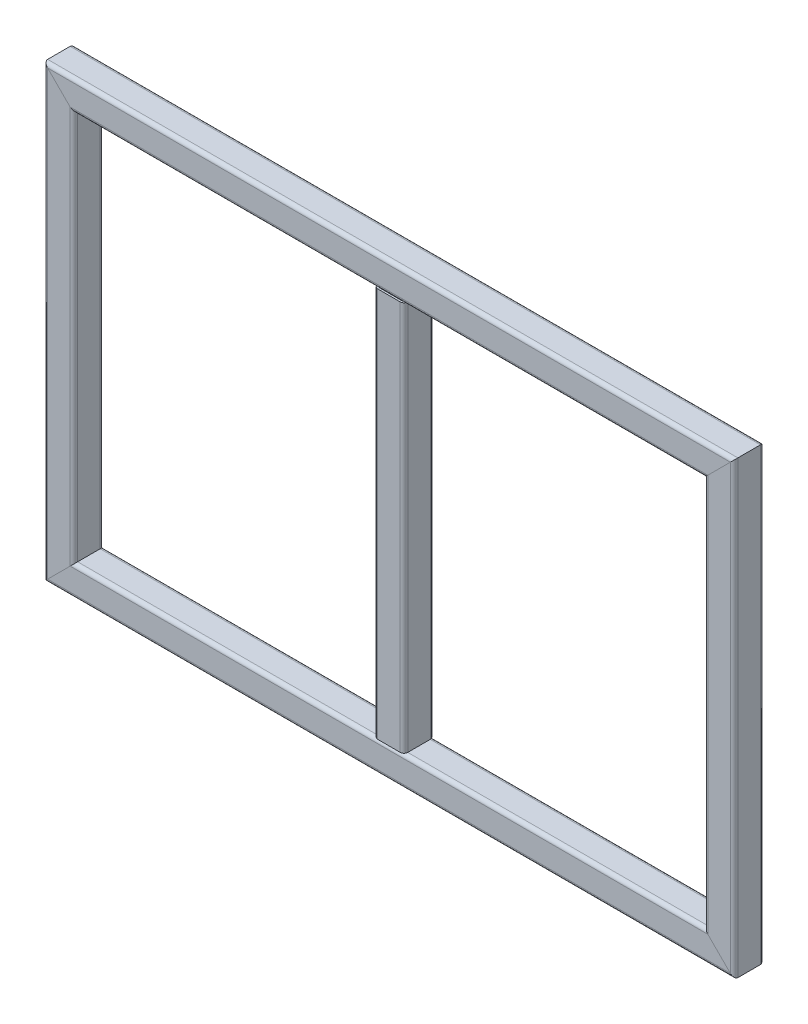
ISO-10303-21;
HEADER;
FILE_DESCRIPTION(('STEP AP214'),'2;1');
FILE_NAME('part.step','',(''),(''),'','','');
FILE_SCHEMA(('AUTOMOTIVE_DESIGN { 1 0 10303 214 1 1 1 1 }'));
ENDSEC;
DATA;
#1=APPLICATION_CONTEXT('core data for automotive mechanical design processes');
#2=APPLICATION_PROTOCOL_DEFINITION('international standard','automotive_design',2000,#1);
#3=PRODUCT_CONTEXT('',#1,'mechanical');
#4=PRODUCT('Part','Part','',(#3));
#5=PRODUCT_RELATED_PRODUCT_CATEGORY('part','',(#4));
#6=PRODUCT_DEFINITION_FORMATION('','',#4);
#7=PRODUCT_DEFINITION_CONTEXT('part definition',#1,'design');
#8=PRODUCT_DEFINITION('design','',#6,#7);
#9=PRODUCT_DEFINITION_SHAPE('','',#8);
#10=(LENGTH_UNIT() NAMED_UNIT(*) SI_UNIT(.MILLI.,.METRE.));
#11=(NAMED_UNIT(*) PLANE_ANGLE_UNIT() SI_UNIT($,.RADIAN.));
#12=(NAMED_UNIT(*) SI_UNIT($,.STERADIAN.) SOLID_ANGLE_UNIT());
#13=UNCERTAINTY_MEASURE_WITH_UNIT(LENGTH_MEASURE(1.E-05),#10,'distance_accuracy_value','');
#14=(GEOMETRIC_REPRESENTATION_CONTEXT(3) GLOBAL_UNCERTAINTY_ASSIGNED_CONTEXT((#13)) GLOBAL_UNIT_ASSIGNED_CONTEXT((#10,
#11,#12)) REPRESENTATION_CONTEXT('',''));
#15=CARTESIAN_POINT('',(0.,0.,0.));
#16=DIRECTION('',(0.,0.,1.));
#17=DIRECTION('',(1.,0.,0.));
#18=AXIS2_PLACEMENT_3D('',#15,#16,#17);
#19=CARTESIAN_POINT('',(-910.,-80.0000000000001,30.));
#20=DIRECTION('',(0.,-1.,0.));
#21=DIRECTION('',(0.,0.,-1.));
#22=AXIS2_PLACEMENT_3D('',#19,#20,#21);
#23=CYLINDRICAL_SURFACE('',#22,10.);
#24=CARTESIAN_POINT('',(-910.,-1230.,30.));
#25=DIRECTION('',(0.707106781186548,-0.707106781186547,0.));
#26=DIRECTION('',(-0.707106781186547,-0.707106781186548,0.));
#27=AXIS2_PLACEMENT_3D('',#24,#25,#26);
#28=ELLIPSE('',#27,14.142135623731,10.);
#29=CARTESIAN_POINT('',(-910.,-1230.,40.));
#30=VERTEX_POINT('',#29);
#31=CARTESIAN_POINT('',(-920.,-1240.,30.));
#32=VERTEX_POINT('',#31);
#33=EDGE_CURVE('E215',#30,#32,#28,.T.);
#34=ORIENTED_EDGE('',*,*,#33,.F.);
#35=DIRECTION('',(0.,-1.,0.));
#36=VECTOR('',#35,1.);
#37=CARTESIAN_POINT('',(-910.,-80.0000000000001,40.));
#38=LINE('',#37,#36);
#39=CARTESIAN_POINT('',(-910.,-50.,40.));
#40=VERTEX_POINT('',#39);
#41=EDGE_CURVE('E295',#40,#30,#38,.T.);
#42=ORIENTED_EDGE('',*,*,#41,.F.);
#43=CARTESIAN_POINT('',(-910.,-50.,30.));
#44=DIRECTION('',(0.707106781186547,0.707106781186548,0.));
#45=DIRECTION('',(0.707106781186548,-0.707106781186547,0.));
#46=AXIS2_PLACEMENT_3D('',#43,#44,#45);
#47=ELLIPSE('',#46,14.142135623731,10.);
#48=CARTESIAN_POINT('',(-920.,-40.,30.));
#49=VERTEX_POINT('',#48);
#50=EDGE_CURVE('E206',#49,#40,#47,.T.);
#51=ORIENTED_EDGE('',*,*,#50,.F.);
#52=DIRECTION('',(0.,-1.,0.));
#53=VECTOR('',#52,1.);
#54=CARTESIAN_POINT('',(-920.,-80.0000000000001,30.));
#55=LINE('',#54,#53);
#56=EDGE_CURVE('E75',#49,#32,#55,.T.);
#57=ORIENTED_EDGE('',*,*,#56,.T.);
#58=EDGE_LOOP('',(#34,#42,#51,#57));
#59=FACE_BOUND('',#58,.T.);
#60=ADVANCED_FACE('F71',(#59),#23,.T.);
#61=CARTESIAN_POINT('',(-910.,-80.0000000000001,40.));
#62=DIRECTION('',(0.,0.,-1.));
#63=DIRECTION('',(-1.,0.,0.));
#64=AXIS2_PLACEMENT_3D('',#61,#62,#63);
#65=PLANE('',#64);
#66=DIRECTION('',(-0.707106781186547,-0.707106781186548,0.));
#67=VECTOR('',#66,1.);
#68=CARTESIAN_POINT('',(-335.,-655.,40.));
#69=LINE('',#68,#67);
#70=CARTESIAN_POINT('',(-850.,-1170.,40.));
#71=VERTEX_POINT('',#70);
#72=EDGE_CURVE('E212',#71,#30,#69,.T.);
#73=ORIENTED_EDGE('',*,*,#72,.F.);
#74=DIRECTION('',(0.,-1.,0.));
#75=VECTOR('',#74,1.);
#76=CARTESIAN_POINT('',(-850.,-80.0000000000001,40.));
#77=LINE('',#76,#75);
#78=CARTESIAN_POINT('',(-850.,-110.,40.));
#79=VERTEX_POINT('',#78);
#80=EDGE_CURVE('E293',#79,#71,#77,.T.);
#81=ORIENTED_EDGE('',*,*,#80,.F.);
#82=DIRECTION('',(0.707106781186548,-0.707106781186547,0.));
#83=VECTOR('',#82,1.);
#84=CARTESIAN_POINT('',(-895.,-65.,40.));
#85=LINE('',#84,#83);
#86=EDGE_CURVE('E311',#40,#79,#85,.T.);
#87=ORIENTED_EDGE('',*,*,#86,.F.);
#88=ORIENTED_EDGE('',*,*,#41,.T.);
#89=EDGE_LOOP('',(#73,#81,#87,#88));
#90=FACE_BOUND('',#89,.T.);
#91=ADVANCED_FACE('F302',(#90),#65,.F.);
#92=CARTESIAN_POINT('',(-850.,-80.0000000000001,30.));
#93=DIRECTION('',(0.,-1.,0.));
#94=DIRECTION('',(0.,0.,-1.));
#95=AXIS2_PLACEMENT_3D('',#92,#93,#94);
#96=CYLINDRICAL_SURFACE('',#95,10.);
#97=CARTESIAN_POINT('',(-850.,-1170.,30.));
#98=DIRECTION('',(0.707106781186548,-0.707106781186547,0.));
#99=DIRECTION('',(-0.707106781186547,-0.707106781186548,0.));
#100=AXIS2_PLACEMENT_3D('',#97,#98,#99);
#101=ELLIPSE('',#100,14.142135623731,10.);
#102=CARTESIAN_POINT('',(-840.,-1160.,30.));
#103=VERTEX_POINT('',#102);
#104=EDGE_CURVE('E13',#103,#71,#101,.T.);
#105=ORIENTED_EDGE('',*,*,#104,.F.);
#106=DIRECTION('',(0.,-1.,0.));
#107=VECTOR('',#106,1.);
#108=CARTESIAN_POINT('',(-840.,-80.0000000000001,30.));
#109=LINE('',#108,#107);
#110=CARTESIAN_POINT('',(-840.,-120.,30.));
#111=VERTEX_POINT('',#110);
#112=EDGE_CURVE('E290',#111,#103,#109,.T.);
#113=ORIENTED_EDGE('',*,*,#112,.F.);
#114=CARTESIAN_POINT('',(-850.,-110.,30.));
#115=DIRECTION('',(0.707106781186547,0.707106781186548,0.));
#116=DIRECTION('',(0.707106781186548,-0.707106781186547,0.));
#117=AXIS2_PLACEMENT_3D('',#114,#115,#116);
#118=ELLIPSE('',#117,14.142135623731,10.);
#119=EDGE_CURVE('E308',#79,#111,#118,.T.);
#120=ORIENTED_EDGE('',*,*,#119,.F.);
#121=ORIENTED_EDGE('',*,*,#80,.T.);
#122=EDGE_LOOP('',(#105,#113,#120,#121));
#123=FACE_BOUND('',#122,.T.);
#124=ADVANCED_FACE('F305',(#123),#96,.T.);
#125=CARTESIAN_POINT('',(-840.,-80.0000000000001,-30.));
#126=DIRECTION('',(-1.,0.,0.));
#127=DIRECTION('',(0.,0.,1.));
#128=AXIS2_PLACEMENT_3D('',#125,#126,#127);
#129=PLANE('',#128);
#130=DIRECTION('',(0.,0.,1.));
#131=VECTOR('',#130,1.);
#132=CARTESIAN_POINT('',(-840.,-1160.,-30.));
#133=LINE('',#132,#131);
#134=CARTESIAN_POINT('',(-840.,-1160.,-30.));
#135=VERTEX_POINT('',#134);
#136=EDGE_CURVE('E81',#135,#103,#133,.T.);
#137=ORIENTED_EDGE('',*,*,#136,.F.);
#138=DIRECTION('',(0.,-1.,0.));
#139=VECTOR('',#138,1.);
#140=CARTESIAN_POINT('',(-840.,-80.0000000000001,-30.));
#141=LINE('',#140,#139);
#142=CARTESIAN_POINT('',(-840.,-120.,-30.));
#143=VERTEX_POINT('',#142);
#144=EDGE_CURVE('E287',#143,#135,#141,.T.);
#145=ORIENTED_EDGE('',*,*,#144,.F.);
#146=DIRECTION('',(0.,0.,-1.));
#147=VECTOR('',#146,1.);
#148=CARTESIAN_POINT('',(-840.,-120.,-30.));
#149=LINE('',#148,#147);
#150=EDGE_CURVE('E310',#111,#143,#149,.T.);
#151=ORIENTED_EDGE('',*,*,#150,.F.);
#152=ORIENTED_EDGE('',*,*,#112,.T.);
#153=EDGE_LOOP('',(#137,#145,#151,#152));
#154=FACE_BOUND('',#153,.T.);
#155=ADVANCED_FACE('F321',(#154),#129,.F.);
#156=CARTESIAN_POINT('',(-850.,-80.0000000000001,-30.));
#157=DIRECTION('',(0.,-1.,0.));
#158=DIRECTION('',(0.,0.,-1.));
#159=AXIS2_PLACEMENT_3D('',#156,#157,#158);
#160=CYLINDRICAL_SURFACE('',#159,10.);
#161=CARTESIAN_POINT('',(-850.,-1170.,-30.));
#162=DIRECTION('',(0.707106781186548,-0.707106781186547,0.));
#163=DIRECTION('',(-0.707106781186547,-0.707106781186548,0.));
#164=AXIS2_PLACEMENT_3D('',#161,#162,#163);
#165=ELLIPSE('',#164,14.142135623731,10.);
#166=CARTESIAN_POINT('',(-850.,-1170.,-40.));
#167=VERTEX_POINT('',#166);
#168=EDGE_CURVE('E230',#167,#135,#165,.T.);
#169=ORIENTED_EDGE('',*,*,#168,.F.);
#170=DIRECTION('',(0.,-1.,0.));
#171=VECTOR('',#170,1.);
#172=CARTESIAN_POINT('',(-850.,-80.0000000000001,-40.));
#173=LINE('',#172,#171);
#174=CARTESIAN_POINT('',(-850.,-110.,-40.));
#175=VERTEX_POINT('',#174);
#176=EDGE_CURVE('E284',#175,#167,#173,.T.);
#177=ORIENTED_EDGE('',*,*,#176,.F.);
#178=CARTESIAN_POINT('',(-850.,-110.,-30.));
#179=DIRECTION('',(0.707106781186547,0.707106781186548,0.));
#180=DIRECTION('',(0.707106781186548,-0.707106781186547,0.));
#181=AXIS2_PLACEMENT_3D('',#178,#179,#180);
#182=ELLIPSE('',#181,14.142135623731,10.);
#183=EDGE_CURVE('E217',#143,#175,#182,.T.);
#184=ORIENTED_EDGE('',*,*,#183,.F.);
#185=ORIENTED_EDGE('',*,*,#144,.T.);
#186=EDGE_LOOP('',(#169,#177,#184,#185));
#187=FACE_BOUND('',#186,.T.);
#188=ADVANCED_FACE('F319',(#187),#160,.T.);
#189=CARTESIAN_POINT('',(-850.,-80.0000000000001,-40.));
#190=DIRECTION('',(0.,0.,1.));
#191=DIRECTION('',(1.,0.,0.));
#192=AXIS2_PLACEMENT_3D('',#189,#190,#191);
#193=PLANE('',#192);
#194=DIRECTION('',(0.707106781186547,0.707106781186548,0.));
#195=VECTOR('',#194,1.);
#196=CARTESIAN_POINT('',(-305.,-625.,-40.));
#197=LINE('',#196,#195);
#198=CARTESIAN_POINT('',(-910.,-1230.,-40.));
#199=VERTEX_POINT('',#198);
#200=EDGE_CURVE('E233',#199,#167,#197,.T.);
#201=ORIENTED_EDGE('',*,*,#200,.F.);
#202=DIRECTION('',(0.,-1.,0.));
#203=VECTOR('',#202,1.);
#204=CARTESIAN_POINT('',(-910.,-80.0000000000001,-40.));
#205=LINE('',#204,#203);
#206=CARTESIAN_POINT('',(-910.,-50.,-40.));
#207=VERTEX_POINT('',#206);
#208=EDGE_CURVE('E282',#207,#199,#205,.T.);
#209=ORIENTED_EDGE('',*,*,#208,.F.);
#210=DIRECTION('',(-0.707106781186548,0.707106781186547,0.));
#211=VECTOR('',#210,1.);
#212=CARTESIAN_POINT('',(-865.,-95.0000000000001,-40.));
#213=LINE('',#212,#211);
#214=EDGE_CURVE('E211',#175,#207,#213,.T.);
#215=ORIENTED_EDGE('',*,*,#214,.F.);
#216=ORIENTED_EDGE('',*,*,#176,.T.);
#217=EDGE_LOOP('',(#201,#209,#215,#216));
#218=FACE_BOUND('',#217,.T.);
#219=ADVANCED_FACE('F323',(#218),#193,.F.);
#220=CARTESIAN_POINT('',(-910.,-80.0000000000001,-30.));
#221=DIRECTION('',(0.,-1.,0.));
#222=DIRECTION('',(0.,0.,-1.));
#223=AXIS2_PLACEMENT_3D('',#220,#221,#222);
#224=CYLINDRICAL_SURFACE('',#223,10.);
#225=CARTESIAN_POINT('',(-910.,-1230.,-30.));
#226=DIRECTION('',(0.707106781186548,-0.707106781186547,0.));
#227=DIRECTION('',(-0.707106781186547,-0.707106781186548,0.));
#228=AXIS2_PLACEMENT_3D('',#225,#226,#227);
#229=ELLIPSE('',#228,14.142135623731,10.);
#230=CARTESIAN_POINT('',(-920.,-1240.,-30.));
#231=VERTEX_POINT('',#230);
#232=EDGE_CURVE('E194',#231,#199,#229,.T.);
#233=ORIENTED_EDGE('',*,*,#232,.F.);
#234=DIRECTION('',(0.,-1.,0.));
#235=VECTOR('',#234,1.);
#236=CARTESIAN_POINT('',(-920.,-80.0000000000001,-30.));
#237=LINE('',#236,#235);
#238=CARTESIAN_POINT('',(-920.,-40.,-30.));
#239=VERTEX_POINT('',#238);
#240=EDGE_CURVE('E186',#239,#231,#237,.T.);
#241=ORIENTED_EDGE('',*,*,#240,.F.);
#242=CARTESIAN_POINT('',(-910.,-50.,-30.));
#243=DIRECTION('',(0.707106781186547,0.707106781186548,0.));
#244=DIRECTION('',(0.707106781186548,-0.707106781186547,0.));
#245=AXIS2_PLACEMENT_3D('',#242,#243,#244);
#246=ELLIPSE('',#245,14.142135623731,10.);
#247=EDGE_CURVE('E191',#207,#239,#246,.T.);
#248=ORIENTED_EDGE('',*,*,#247,.F.);
#249=ORIENTED_EDGE('',*,*,#208,.T.);
#250=EDGE_LOOP('',(#233,#241,#248,#249));
#251=FACE_BOUND('',#250,.T.);
#252=ADVANCED_FACE('F188',(#251),#224,.T.);
#253=CARTESIAN_POINT('',(-850.,-80.0000000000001,30.));
#254=DIRECTION('',(0.,-1.,0.));
#255=DIRECTION('',(0.,0.,-1.));
#256=AXIS2_PLACEMENT_3D('',#253,#254,#255);
#257=CYLINDRICAL_SURFACE('',#256,5.);
#258=DIRECTION('',(0.,-1.,0.));
#259=VECTOR('',#258,1.);
#260=CARTESIAN_POINT('',(-845.,-80.0000000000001,30.));
#261=LINE('',#260,#259);
#262=CARTESIAN_POINT('',(-845.,-115.,30.));
#263=VERTEX_POINT('',#262);
#264=CARTESIAN_POINT('',(-845.,-1165.,30.));
#265=VERTEX_POINT('',#264);
#266=EDGE_CURVE('E239',#263,#265,#261,.T.);
#267=ORIENTED_EDGE('',*,*,#266,.T.);
#268=CARTESIAN_POINT('',(-850.,-1170.,30.));
#269=DIRECTION('',(0.707106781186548,-0.707106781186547,0.));
#270=DIRECTION('',(-0.707106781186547,-0.707106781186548,0.));
#271=AXIS2_PLACEMENT_3D('',#268,#269,#270);
#272=ELLIPSE('',#271,7.07106781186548,5.);
#273=CARTESIAN_POINT('',(-850.,-1170.,35.));
#274=VERTEX_POINT('',#273);
#275=EDGE_CURVE('E117',#265,#274,#272,.T.);
#276=ORIENTED_EDGE('',*,*,#275,.T.);
#277=DIRECTION('',(0.,-1.,0.));
#278=VECTOR('',#277,1.);
#279=CARTESIAN_POINT('',(-850.,-80.0000000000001,35.));
#280=LINE('',#279,#278);
#281=CARTESIAN_POINT('',(-850.,-110.,35.));
#282=VERTEX_POINT('',#281);
#283=EDGE_CURVE('E242',#282,#274,#280,.T.);
#284=ORIENTED_EDGE('',*,*,#283,.F.);
#285=CARTESIAN_POINT('',(-850.,-110.,30.));
#286=DIRECTION('',(0.707106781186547,0.707106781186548,0.));
#287=DIRECTION('',(0.707106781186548,-0.707106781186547,0.));
#288=AXIS2_PLACEMENT_3D('',#285,#286,#287);
#289=ELLIPSE('',#288,7.07106781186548,5.);
#290=EDGE_CURVE('E238',#282,#263,#289,.T.);
#291=ORIENTED_EDGE('',*,*,#290,.T.);
#292=EDGE_LOOP('',(#267,#276,#284,#291));
#293=FACE_BOUND('',#292,.T.);
#294=ADVANCED_FACE('F330',(#293),#257,.F.);
#295=CARTESIAN_POINT('',(-910.,-80.0000000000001,35.));
#296=DIRECTION('',(0.,0.,-1.));
#297=DIRECTION('',(-1.,0.,0.));
#298=AXIS2_PLACEMENT_3D('',#295,#296,#297);
#299=PLANE('',#298);
#300=ORIENTED_EDGE('',*,*,#283,.T.);
#301=DIRECTION('',(-0.707106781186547,-0.707106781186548,0.));
#302=VECTOR('',#301,1.);
#303=CARTESIAN_POINT('',(-335.,-655.,35.));
#304=LINE('',#303,#302);
#305=CARTESIAN_POINT('',(-910.,-1230.,35.));
#306=VERTEX_POINT('',#305);
#307=EDGE_CURVE('E90',#274,#306,#304,.T.);
#308=ORIENTED_EDGE('',*,*,#307,.T.);
#309=DIRECTION('',(0.,-1.,0.));
#310=VECTOR('',#309,1.);
#311=CARTESIAN_POINT('',(-910.,-80.0000000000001,35.));
#312=LINE('',#311,#310);
#313=CARTESIAN_POINT('',(-910.,-50.,35.));
#314=VERTEX_POINT('',#313);
#315=EDGE_CURVE('E247',#314,#306,#312,.T.);
#316=ORIENTED_EDGE('',*,*,#315,.F.);
#317=DIRECTION('',(0.707106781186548,-0.707106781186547,0.));
#318=VECTOR('',#317,1.);
#319=CARTESIAN_POINT('',(-895.,-65.,35.));
#320=LINE('',#319,#318);
#321=EDGE_CURVE('E241',#314,#282,#320,.T.);
#322=ORIENTED_EDGE('',*,*,#321,.T.);
#323=EDGE_LOOP('',(#300,#308,#316,#322));
#324=FACE_BOUND('',#323,.T.);
#325=ADVANCED_FACE('F372',(#324),#299,.T.);
#326=CARTESIAN_POINT('',(-910.,-80.0000000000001,30.));
#327=DIRECTION('',(0.,-1.,0.));
#328=DIRECTION('',(0.,0.,-1.));
#329=AXIS2_PLACEMENT_3D('',#326,#327,#328);
#330=CYLINDRICAL_SURFACE('',#329,5.);
#331=ORIENTED_EDGE('',*,*,#315,.T.);
#332=CARTESIAN_POINT('',(-910.,-1230.,30.));
#333=DIRECTION('',(0.707106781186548,-0.707106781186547,0.));
#334=DIRECTION('',(-0.707106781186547,-0.707106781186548,0.));
#335=AXIS2_PLACEMENT_3D('',#332,#333,#334);
#336=ELLIPSE('',#335,7.07106781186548,5.);
#337=CARTESIAN_POINT('',(-915.,-1235.,30.));
#338=VERTEX_POINT('',#337);
#339=EDGE_CURVE('E243',#306,#338,#336,.T.);
#340=ORIENTED_EDGE('',*,*,#339,.T.);
#341=DIRECTION('',(0.,-1.,0.));
#342=VECTOR('',#341,1.);
#343=CARTESIAN_POINT('',(-915.,-80.0000000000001,30.));
#344=LINE('',#343,#342);
#345=CARTESIAN_POINT('',(-915.,-45.,30.));
#346=VERTEX_POINT('',#345);
#347=EDGE_CURVE('E252',#346,#338,#344,.T.);
#348=ORIENTED_EDGE('',*,*,#347,.F.);
#349=CARTESIAN_POINT('',(-910.,-50.,30.));
#350=DIRECTION('',(0.707106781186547,0.707106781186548,0.));
#351=DIRECTION('',(0.707106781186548,-0.707106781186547,0.));
#352=AXIS2_PLACEMENT_3D('',#349,#350,#351);
#353=ELLIPSE('',#352,7.07106781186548,5.);
#354=EDGE_CURVE('E246',#346,#314,#353,.T.);
#355=ORIENTED_EDGE('',*,*,#354,.T.);
#356=EDGE_LOOP('',(#331,#340,#348,#355));
#357=FACE_BOUND('',#356,.T.);
#358=ADVANCED_FACE('F383',(#357),#330,.F.);
#359=CARTESIAN_POINT('',(-915.,-80.0000000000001,30.));
#360=DIRECTION('',(1.,0.,0.));
#361=DIRECTION('',(0.,0.,-1.));
#362=AXIS2_PLACEMENT_3D('',#359,#360,#361);
#363=PLANE('',#362);
#364=ORIENTED_EDGE('',*,*,#347,.T.);
#365=DIRECTION('',(0.,0.,-1.));
#366=VECTOR('',#365,1.);
#367=CARTESIAN_POINT('',(-915.,-1235.,30.));
#368=LINE('',#367,#366);
#369=CARTESIAN_POINT('',(-915.,-1235.,-30.));
#370=VERTEX_POINT('',#369);
#371=EDGE_CURVE('E248',#338,#370,#368,.T.);
#372=ORIENTED_EDGE('',*,*,#371,.T.);
#373=DIRECTION('',(0.,-1.,0.));
#374=VECTOR('',#373,1.);
#375=CARTESIAN_POINT('',(-915.,-80.0000000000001,-30.));
#376=LINE('',#375,#374);
#377=CARTESIAN_POINT('',(-915.,-45.,-30.));
#378=VERTEX_POINT('',#377);
#379=EDGE_CURVE('E257',#378,#370,#376,.T.);
#380=ORIENTED_EDGE('',*,*,#379,.F.);
#381=DIRECTION('',(0.,0.,1.));
#382=VECTOR('',#381,1.);
#383=CARTESIAN_POINT('',(-915.,-45.,30.));
#384=LINE('',#383,#382);
#385=EDGE_CURVE('E251',#378,#346,#384,.T.);
#386=ORIENTED_EDGE('',*,*,#385,.T.);
#387=EDGE_LOOP('',(#364,#372,#380,#386));
#388=FACE_BOUND('',#387,.T.);
#389=ADVANCED_FACE('F394',(#388),#363,.T.);
#390=CARTESIAN_POINT('',(-910.,-80.0000000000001,-30.));
#391=DIRECTION('',(0.,-1.,0.));
#392=DIRECTION('',(0.,0.,-1.));
#393=AXIS2_PLACEMENT_3D('',#390,#391,#392);
#394=CYLINDRICAL_SURFACE('',#393,5.);
#395=ORIENTED_EDGE('',*,*,#379,.T.);
#396=CARTESIAN_POINT('',(-910.,-1230.,-30.));
#397=DIRECTION('',(0.707106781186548,-0.707106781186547,0.));
#398=DIRECTION('',(-0.707106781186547,-0.707106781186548,0.));
#399=AXIS2_PLACEMENT_3D('',#396,#397,#398);
#400=ELLIPSE('',#399,7.07106781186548,5.);
#401=CARTESIAN_POINT('',(-910.,-1230.,-35.));
#402=VERTEX_POINT('',#401);
#403=EDGE_CURVE('E253',#370,#402,#400,.T.);
#404=ORIENTED_EDGE('',*,*,#403,.T.);
#405=DIRECTION('',(0.,-1.,0.));
#406=VECTOR('',#405,1.);
#407=CARTESIAN_POINT('',(-910.,-80.0000000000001,-35.));
#408=LINE('',#407,#406);
#409=CARTESIAN_POINT('',(-910.,-50.,-35.));
#410=VERTEX_POINT('',#409);
#411=EDGE_CURVE('E262',#410,#402,#408,.T.);
#412=ORIENTED_EDGE('',*,*,#411,.F.);
#413=CARTESIAN_POINT('',(-910.,-50.,-30.));
#414=DIRECTION('',(0.707106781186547,0.707106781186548,0.));
#415=DIRECTION('',(0.707106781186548,-0.707106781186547,0.));
#416=AXIS2_PLACEMENT_3D('',#413,#414,#415);
#417=ELLIPSE('',#416,7.07106781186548,5.);
#418=EDGE_CURVE('E256',#410,#378,#417,.T.);
#419=ORIENTED_EDGE('',*,*,#418,.T.);
#420=EDGE_LOOP('',(#395,#404,#412,#419));
#421=FACE_BOUND('',#420,.T.);
#422=ADVANCED_FACE('F405',(#421),#394,.F.);
#423=CARTESIAN_POINT('',(-850.,-80.0000000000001,-35.));
#424=DIRECTION('',(0.,0.,1.));
#425=DIRECTION('',(1.,0.,0.));
#426=AXIS2_PLACEMENT_3D('',#423,#424,#425);
#427=PLANE('',#426);
#428=ORIENTED_EDGE('',*,*,#411,.T.);
#429=DIRECTION('',(0.707106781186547,0.707106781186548,0.));
#430=VECTOR('',#429,1.);
#431=CARTESIAN_POINT('',(-305.,-625.,-35.));
#432=LINE('',#431,#430);
#433=CARTESIAN_POINT('',(-850.,-1170.,-35.));
#434=VERTEX_POINT('',#433);
#435=EDGE_CURVE('E258',#402,#434,#432,.T.);
#436=ORIENTED_EDGE('',*,*,#435,.T.);
#437=DIRECTION('',(0.,-1.,0.));
#438=VECTOR('',#437,1.);
#439=CARTESIAN_POINT('',(-850.,-80.0000000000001,-35.));
#440=LINE('',#439,#438);
#441=CARTESIAN_POINT('',(-850.,-110.,-35.));
#442=VERTEX_POINT('',#441);
#443=EDGE_CURVE('E266',#442,#434,#440,.T.);
#444=ORIENTED_EDGE('',*,*,#443,.F.);
#445=DIRECTION('',(-0.707106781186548,0.707106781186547,0.));
#446=VECTOR('',#445,1.);
#447=CARTESIAN_POINT('',(-865.,-95.0000000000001,-35.));
#448=LINE('',#447,#446);
#449=EDGE_CURVE('E261',#442,#410,#448,.T.);
#450=ORIENTED_EDGE('',*,*,#449,.T.);
#451=EDGE_LOOP('',(#428,#436,#444,#450));
#452=FACE_BOUND('',#451,.T.);
#453=ADVANCED_FACE('F416',(#452),#427,.T.);
#454=CARTESIAN_POINT('',(-850.,-80.0000000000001,-30.));
#455=DIRECTION('',(0.,-1.,0.));
#456=DIRECTION('',(0.,0.,-1.));
#457=AXIS2_PLACEMENT_3D('',#454,#455,#456);
#458=CYLINDRICAL_SURFACE('',#457,5.);
#459=ORIENTED_EDGE('',*,*,#443,.T.);
#460=CARTESIAN_POINT('',(-850.,-1170.,-30.));
#461=DIRECTION('',(0.707106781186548,-0.707106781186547,0.));
#462=DIRECTION('',(-0.707106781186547,-0.707106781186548,0.));
#463=AXIS2_PLACEMENT_3D('',#460,#461,#462);
#464=ELLIPSE('',#463,7.07106781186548,5.);
#465=CARTESIAN_POINT('',(-845.,-1165.,-30.));
#466=VERTEX_POINT('',#465);
#467=EDGE_CURVE('E263',#434,#466,#464,.T.);
#468=ORIENTED_EDGE('',*,*,#467,.T.);
#469=DIRECTION('',(0.,-1.,0.));
#470=VECTOR('',#469,1.);
#471=CARTESIAN_POINT('',(-845.,-80.0000000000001,-30.));
#472=LINE('',#471,#470);
#473=CARTESIAN_POINT('',(-845.,-115.,-30.));
#474=VERTEX_POINT('',#473);
#475=EDGE_CURVE('E224',#474,#466,#472,.T.);
#476=ORIENTED_EDGE('',*,*,#475,.F.);
#477=CARTESIAN_POINT('',(-850.,-110.,-30.));
#478=DIRECTION('',(0.707106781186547,0.707106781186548,0.));
#479=DIRECTION('',(0.707106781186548,-0.707106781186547,0.));
#480=AXIS2_PLACEMENT_3D('',#477,#478,#479);
#481=ELLIPSE('',#480,7.07106781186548,5.);
#482=EDGE_CURVE('E265',#474,#442,#481,.T.);
#483=ORIENTED_EDGE('',*,*,#482,.T.);
#484=EDGE_LOOP('',(#459,#468,#476,#483));
#485=FACE_BOUND('',#484,.T.);
#486=ADVANCED_FACE('F427',(#485),#458,.F.);
#487=CARTESIAN_POINT('',(-845.,-80.0000000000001,-30.));
#488=DIRECTION('',(-1.,0.,0.));
#489=DIRECTION('',(0.,0.,1.));
#490=AXIS2_PLACEMENT_3D('',#487,#488,#489);
#491=PLANE('',#490);
#492=ORIENTED_EDGE('',*,*,#475,.T.);
#493=DIRECTION('',(0.,0.,1.));
#494=VECTOR('',#493,1.);
#495=CARTESIAN_POINT('',(-845.,-1165.,-30.));
#496=LINE('',#495,#494);
#497=EDGE_CURVE('E112',#466,#265,#496,.T.);
#498=ORIENTED_EDGE('',*,*,#497,.T.);
#499=ORIENTED_EDGE('',*,*,#266,.F.);
#500=DIRECTION('',(0.,0.,-1.));
#501=VECTOR('',#500,1.);
#502=CARTESIAN_POINT('',(-845.,-115.,-30.));
#503=LINE('',#502,#501);
#504=EDGE_CURVE('E199',#263,#474,#503,.T.);
#505=ORIENTED_EDGE('',*,*,#504,.T.);
#506=EDGE_LOOP('',(#492,#498,#499,#505));
#507=FACE_BOUND('',#506,.T.);
#508=ADVANCED_FACE('F438',(#507),#491,.T.);
#509=CARTESIAN_POINT('',(-920.,-80.0000000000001,30.));
#510=DIRECTION('',(1.,0.,0.));
#511=DIRECTION('',(0.,0.,-1.));
#512=AXIS2_PLACEMENT_3D('',#509,#510,#511);
#513=PLANE('',#512);
#514=DIRECTION('',(0.,0.,-1.));
#515=VECTOR('',#514,1.);
#516=CARTESIAN_POINT('',(-920.,-1240.,30.));
#517=LINE('',#516,#515);
#518=EDGE_CURVE('E226',#32,#231,#517,.T.);
#519=ORIENTED_EDGE('',*,*,#518,.F.);
#520=ORIENTED_EDGE('',*,*,#56,.F.);
#521=DIRECTION('',(0.,0.,1.));
#522=VECTOR('',#521,1.);
#523=CARTESIAN_POINT('',(-920.,-40.,30.));
#524=LINE('',#523,#522);
#525=EDGE_CURVE('E198',#239,#49,#524,.T.);
#526=ORIENTED_EDGE('',*,*,#525,.F.);
#527=ORIENTED_EDGE('',*,*,#240,.T.);
#528=EDGE_LOOP('',(#519,#520,#526,#527));
#529=FACE_BOUND('',#528,.T.);
#530=ADVANCED_FACE('F202',(#529),#513,.F.);
#531=CARTESIAN_POINT('',(-880.,-80.,0.));
#532=DIRECTION('',(0.707106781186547,0.707106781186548,0.));
#533=DIRECTION('',(-0.707106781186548,0.707106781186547,0.));
#534=AXIS2_PLACEMENT_3D('',#531,#532,#533);
#535=PLANE('',#534);
#536=ORIENTED_EDGE('',*,*,#290,.F.);
#537=ORIENTED_EDGE('',*,*,#321,.F.);
#538=ORIENTED_EDGE('',*,*,#354,.F.);
#539=ORIENTED_EDGE('',*,*,#385,.F.);
#540=ORIENTED_EDGE('',*,*,#418,.F.);
#541=ORIENTED_EDGE('',*,*,#449,.F.);
#542=ORIENTED_EDGE('',*,*,#482,.F.);
#543=ORIENTED_EDGE('',*,*,#504,.F.);
#544=EDGE_LOOP('',(#536,#537,#538,#539,#540,#541,#542,#543));
#545=FACE_BOUND('',#544,.T.);
#546=ORIENTED_EDGE('',*,*,#525,.T.);
#547=ORIENTED_EDGE('',*,*,#50,.T.);
#548=ORIENTED_EDGE('',*,*,#86,.T.);
#549=ORIENTED_EDGE('',*,*,#119,.T.);
#550=ORIENTED_EDGE('',*,*,#150,.T.);
#551=ORIENTED_EDGE('',*,*,#183,.T.);
#552=ORIENTED_EDGE('',*,*,#214,.T.);
#553=ORIENTED_EDGE('',*,*,#247,.T.);
#554=EDGE_LOOP('',(#546,#547,#548,#549,#550,#551,#552,#553));
#555=FACE_BOUND('',#554,.T.);
#556=ADVANCED_FACE('F209',(#545,#555),#535,.T.);
#557=CARTESIAN_POINT('',(-880.,-1200.,0.));
#558=DIRECTION('',(0.707106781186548,-0.707106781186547,0.));
#559=DIRECTION('',(0.707106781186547,0.707106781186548,0.));
#560=AXIS2_PLACEMENT_3D('',#557,#558,#559);
#561=PLANE('',#560);
#562=ORIENTED_EDGE('',*,*,#275,.F.);
#563=ORIENTED_EDGE('',*,*,#497,.F.);
#564=ORIENTED_EDGE('',*,*,#467,.F.);
#565=ORIENTED_EDGE('',*,*,#435,.F.);
#566=ORIENTED_EDGE('',*,*,#403,.F.);
#567=ORIENTED_EDGE('',*,*,#371,.F.);
#568=ORIENTED_EDGE('',*,*,#339,.F.);
#569=ORIENTED_EDGE('',*,*,#307,.F.);
#570=EDGE_LOOP('',(#562,#563,#564,#565,#566,#567,#568,#569));
#571=FACE_BOUND('',#570,.T.);
#572=ORIENTED_EDGE('',*,*,#72,.T.);
#573=ORIENTED_EDGE('',*,*,#33,.T.);
#574=ORIENTED_EDGE('',*,*,#518,.T.);
#575=ORIENTED_EDGE('',*,*,#232,.T.);
#576=ORIENTED_EDGE('',*,*,#200,.T.);
#577=ORIENTED_EDGE('',*,*,#168,.T.);
#578=ORIENTED_EDGE('',*,*,#136,.T.);
#579=ORIENTED_EDGE('',*,*,#104,.T.);
#580=EDGE_LOOP('',(#572,#573,#574,#575,#576,#577,#578,#579));
#581=FACE_BOUND('',#580,.T.);
#582=ADVANCED_FACE('F73',(#571,#581),#561,.T.);
#583=CLOSED_SHELL('',(#60,#91,#124,#155,#188,#219,#252,#294,#325,#358,#389,#422,#453,#486,#508,
#530,#556,#582));
#584=MANIFOLD_SOLID_BREP('B2',#583);
#585=CARTESIAN_POINT('',(-879.999999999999,-1230.,30.));
#586=DIRECTION('',(1.,0.,0.));
#587=DIRECTION('',(0.,1.,0.));
#588=AXIS2_PLACEMENT_3D('',#585,#586,#587);
#589=CYLINDRICAL_SURFACE('',#588,10.);
#590=CARTESIAN_POINT('',(-910.,-1230.,30.));
#591=DIRECTION('',(-0.707106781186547,0.707106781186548,0.));
#592=DIRECTION('',(0.707106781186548,0.707106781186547,0.));
#593=AXIS2_PLACEMENT_3D('',#590,#591,#592);
#594=ELLIPSE('',#593,14.142135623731,10.);
#595=CARTESIAN_POINT('',(-920.,-1240.,30.));
#596=VERTEX_POINT('',#595);
#597=CARTESIAN_POINT('',(-910.,-1230.,40.));
#598=VERTEX_POINT('',#597);
#599=EDGE_CURVE('E697',#596,#598,#594,.T.);
#600=ORIENTED_EDGE('',*,*,#599,.F.);
#601=DIRECTION('',(1.,0.,0.));
#602=VECTOR('',#601,1.);
#603=CARTESIAN_POINT('',(-879.999999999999,-1240.,30.));
#604=LINE('',#603,#602);
#605=CARTESIAN_POINT('',(920.,-1240.,30.));
#606=VERTEX_POINT('',#605);
#607=EDGE_CURVE('E573',#596,#606,#604,.T.);
#608=ORIENTED_EDGE('',*,*,#607,.T.);
#609=CARTESIAN_POINT('',(910.,-1230.,30.));
#610=DIRECTION('',(0.707106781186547,0.707106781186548,0.));
#611=DIRECTION('',(0.707106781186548,-0.707106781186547,0.));
#612=AXIS2_PLACEMENT_3D('',#609,#610,#611);
#613=ELLIPSE('',#612,14.142135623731,10.);
#614=CARTESIAN_POINT('',(910.,-1230.,40.));
#615=VERTEX_POINT('',#614);
#616=EDGE_CURVE('E778',#615,#606,#613,.T.);
#617=ORIENTED_EDGE('',*,*,#616,.F.);
#618=DIRECTION('',(1.,0.,0.));
#619=VECTOR('',#618,1.);
#620=CARTESIAN_POINT('',(-879.999999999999,-1230.,40.));
#621=LINE('',#620,#619);
#622=EDGE_CURVE('E771',#598,#615,#621,.T.);
#623=ORIENTED_EDGE('',*,*,#622,.F.);
#624=EDGE_LOOP('',(#600,#608,#617,#623));
#625=FACE_BOUND('',#624,.T.);
#626=ADVANCED_FACE('F569',(#625),#589,.T.);
#627=CARTESIAN_POINT('',(-879.999999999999,-1230.,40.));
#628=DIRECTION('',(0.,0.,-1.));
#629=DIRECTION('',(-1.,0.,0.));
#630=AXIS2_PLACEMENT_3D('',#627,#628,#629);
#631=PLANE('',#630);
#632=DIRECTION('',(0.707106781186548,0.707106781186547,0.));
#633=VECTOR('',#632,1.);
#634=CARTESIAN_POINT('',(-894.999999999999,-1215.,40.));
#635=LINE('',#634,#633);
#636=CARTESIAN_POINT('',(-850.,-1170.,40.));
#637=VERTEX_POINT('',#636);
#638=EDGE_CURVE('E715',#598,#637,#635,.T.);
#639=ORIENTED_EDGE('',*,*,#638,.F.);
#640=ORIENTED_EDGE('',*,*,#622,.T.);
#641=DIRECTION('',(0.707106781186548,-0.707106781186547,0.));
#642=VECTOR('',#641,1.);
#643=CARTESIAN_POINT('',(15.0000000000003,-335.,40.));
#644=LINE('',#643,#642);
#645=CARTESIAN_POINT('',(850.,-1170.,40.));
#646=VERTEX_POINT('',#645);
#647=EDGE_CURVE('E687',#646,#615,#644,.T.);
#648=ORIENTED_EDGE('',*,*,#647,.F.);
#649=DIRECTION('',(1.,0.,0.));
#650=VECTOR('',#649,1.);
#651=CARTESIAN_POINT('',(-879.999999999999,-1170.,40.));
#652=LINE('',#651,#650);
#653=EDGE_CURVE('E770',#637,#646,#652,.T.);
#654=ORIENTED_EDGE('',*,*,#653,.F.);
#655=EDGE_LOOP('',(#639,#640,#648,#654));
#656=FACE_BOUND('',#655,.T.);
#657=ADVANCED_FACE('F825',(#656),#631,.F.);
#658=CARTESIAN_POINT('',(-879.999999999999,-1170.,30.));
#659=DIRECTION('',(1.,0.,0.));
#660=DIRECTION('',(0.,1.,0.));
#661=AXIS2_PLACEMENT_3D('',#658,#659,#660);
#662=CYLINDRICAL_SURFACE('',#661,10.);
#663=CARTESIAN_POINT('',(-850.,-1170.,30.));
#664=DIRECTION('',(-0.707106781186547,0.707106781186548,0.));
#665=DIRECTION('',(0.707106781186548,0.707106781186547,0.));
#666=AXIS2_PLACEMENT_3D('',#663,#664,#665);
#667=ELLIPSE('',#666,14.142135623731,10.);
#668=CARTESIAN_POINT('',(-840.,-1160.,30.));
#669=VERTEX_POINT('',#668);
#670=EDGE_CURVE('E712',#637,#669,#667,.T.);
#671=ORIENTED_EDGE('',*,*,#670,.F.);
#672=ORIENTED_EDGE('',*,*,#653,.T.);
#673=CARTESIAN_POINT('',(850.,-1170.,30.));
#674=DIRECTION('',(0.707106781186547,0.707106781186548,0.));
#675=DIRECTION('',(0.707106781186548,-0.707106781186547,0.));
#676=AXIS2_PLACEMENT_3D('',#673,#674,#675);
#677=ELLIPSE('',#676,14.142135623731,10.);
#678=CARTESIAN_POINT('',(840.,-1160.,30.));
#679=VERTEX_POINT('',#678);
#680=EDGE_CURVE('E698',#679,#646,#677,.T.);
#681=ORIENTED_EDGE('',*,*,#680,.F.);
#682=DIRECTION('',(1.,0.,0.));
#683=VECTOR('',#682,1.);
#684=CARTESIAN_POINT('',(-879.999999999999,-1160.,30.));
#685=LINE('',#684,#683);
#686=EDGE_CURVE('E768',#669,#679,#685,.T.);
#687=ORIENTED_EDGE('',*,*,#686,.F.);
#688=EDGE_LOOP('',(#671,#672,#681,#687));
#689=FACE_BOUND('',#688,.T.);
#690=ADVANCED_FACE('F823',(#689),#662,.T.);
#691=CARTESIAN_POINT('',(-879.999999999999,-1160.,-30.));
#692=DIRECTION('',(0.,-1.,0.));
#693=DIRECTION('',(1.,0.,0.));
#694=AXIS2_PLACEMENT_3D('',#691,#692,#693);
#695=PLANE('',#694);
#696=DIRECTION('',(0.,0.,-1.));
#697=VECTOR('',#696,1.);
#698=CARTESIAN_POINT('',(-840.,-1160.,-30.));
#699=LINE('',#698,#697);
#700=CARTESIAN_POINT('',(-840.,-1160.,-30.));
#701=VERTEX_POINT('',#700);
#702=EDGE_CURVE('E707',#669,#701,#699,.T.);
#703=ORIENTED_EDGE('',*,*,#702,.F.);
#704=ORIENTED_EDGE('',*,*,#686,.T.);
#705=DIRECTION('',(0.,0.,1.));
#706=VECTOR('',#705,1.);
#707=CARTESIAN_POINT('',(840.,-1160.,-30.));
#708=LINE('',#707,#706);
#709=CARTESIAN_POINT('',(840.,-1160.,-30.));
#710=VERTEX_POINT('',#709);
#711=EDGE_CURVE('E817',#710,#679,#708,.T.);
#712=ORIENTED_EDGE('',*,*,#711,.F.);
#713=DIRECTION('',(1.,0.,0.));
#714=VECTOR('',#713,1.);
#715=CARTESIAN_POINT('',(-879.999999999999,-1160.,-30.));
#716=LINE('',#715,#714);
#717=EDGE_CURVE('E766',#701,#710,#716,.T.);
#718=ORIENTED_EDGE('',*,*,#717,.F.);
#719=EDGE_LOOP('',(#703,#704,#712,#718));
#720=FACE_BOUND('',#719,.T.);
#721=ADVANCED_FACE('F832',(#720),#695,.F.);
#722=CARTESIAN_POINT('',(-879.999999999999,-1170.,-30.));
#723=DIRECTION('',(1.,0.,0.));
#724=DIRECTION('',(0.,1.,0.));
#725=AXIS2_PLACEMENT_3D('',#722,#723,#724);
#726=CYLINDRICAL_SURFACE('',#725,10.);
#727=CARTESIAN_POINT('',(-850.,-1170.,-30.));
#728=DIRECTION('',(-0.707106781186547,0.707106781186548,0.));
#729=DIRECTION('',(0.707106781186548,0.707106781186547,0.));
#730=AXIS2_PLACEMENT_3D('',#727,#728,#729);
#731=ELLIPSE('',#730,14.142135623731,10.);
#732=CARTESIAN_POINT('',(-850.,-1170.,-40.));
#733=VERTEX_POINT('',#732);
#734=EDGE_CURVE('E703',#701,#733,#731,.T.);
#735=ORIENTED_EDGE('',*,*,#734,.F.);
#736=ORIENTED_EDGE('',*,*,#717,.T.);
#737=CARTESIAN_POINT('',(850.,-1170.,-30.));
#738=DIRECTION('',(0.707106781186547,0.707106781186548,0.));
#739=DIRECTION('',(0.707106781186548,-0.707106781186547,0.));
#740=AXIS2_PLACEMENT_3D('',#737,#738,#739);
#741=ELLIPSE('',#740,14.142135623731,10.);
#742=CARTESIAN_POINT('',(850.,-1170.,-40.));
#743=VERTEX_POINT('',#742);
#744=EDGE_CURVE('E814',#743,#710,#741,.T.);
#745=ORIENTED_EDGE('',*,*,#744,.F.);
#746=DIRECTION('',(1.,0.,0.));
#747=VECTOR('',#746,1.);
#748=CARTESIAN_POINT('',(-879.999999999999,-1170.,-40.));
#749=LINE('',#748,#747);
#750=EDGE_CURVE('E764',#733,#743,#749,.T.);
#751=ORIENTED_EDGE('',*,*,#750,.F.);
#752=EDGE_LOOP('',(#735,#736,#745,#751));
#753=FACE_BOUND('',#752,.T.);
#754=ADVANCED_FACE('F837',(#753),#726,.T.);
#755=CARTESIAN_POINT('',(-879.999999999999,-1170.,-40.));
#756=DIRECTION('',(0.,0.,1.));
#757=DIRECTION('',(1.,0.,0.));
#758=AXIS2_PLACEMENT_3D('',#755,#756,#757);
#759=PLANE('',#758);
#760=DIRECTION('',(-0.707106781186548,-0.707106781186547,0.));
#761=VECTOR('',#760,1.);
#762=CARTESIAN_POINT('',(-864.999999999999,-1185.,-40.));
#763=LINE('',#762,#761);
#764=CARTESIAN_POINT('',(-910.,-1230.,-40.));
#765=VERTEX_POINT('',#764);
#766=EDGE_CURVE('E579',#733,#765,#763,.T.);
#767=ORIENTED_EDGE('',*,*,#766,.F.);
#768=ORIENTED_EDGE('',*,*,#750,.T.);
#769=DIRECTION('',(-0.707106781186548,0.707106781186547,0.));
#770=VECTOR('',#769,1.);
#771=CARTESIAN_POINT('',(-14.9999999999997,-305.,-40.));
#772=LINE('',#771,#770);
#773=CARTESIAN_POINT('',(910.,-1230.,-40.));
#774=VERTEX_POINT('',#773);
#775=EDGE_CURVE('E811',#774,#743,#772,.T.);
#776=ORIENTED_EDGE('',*,*,#775,.F.);
#777=DIRECTION('',(1.,0.,0.));
#778=VECTOR('',#777,1.);
#779=CARTESIAN_POINT('',(-879.999999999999,-1230.,-40.));
#780=LINE('',#779,#778);
#781=EDGE_CURVE('E722',#765,#774,#780,.T.);
#782=ORIENTED_EDGE('',*,*,#781,.F.);
#783=EDGE_LOOP('',(#767,#768,#776,#782));
#784=FACE_BOUND('',#783,.T.);
#785=ADVANCED_FACE('F841',(#784),#759,.F.);
#786=CARTESIAN_POINT('',(-879.999999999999,-1230.,-30.));
#787=DIRECTION('',(1.,0.,0.));
#788=DIRECTION('',(0.,1.,0.));
#789=AXIS2_PLACEMENT_3D('',#786,#787,#788);
#790=CYLINDRICAL_SURFACE('',#789,10.);
#791=CARTESIAN_POINT('',(-910.,-1230.,-30.));
#792=DIRECTION('',(-0.707106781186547,0.707106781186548,0.));
#793=DIRECTION('',(0.707106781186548,0.707106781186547,0.));
#794=AXIS2_PLACEMENT_3D('',#791,#792,#793);
#795=ELLIPSE('',#794,14.142135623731,10.);
#796=CARTESIAN_POINT('',(-920.,-1240.,-30.));
#797=VERTEX_POINT('',#796);
#798=EDGE_CURVE('E69',#765,#797,#795,.T.);
#799=ORIENTED_EDGE('',*,*,#798,.F.);
#800=ORIENTED_EDGE('',*,*,#781,.T.);
#801=CARTESIAN_POINT('',(910.,-1230.,-30.));
#802=DIRECTION('',(0.707106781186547,0.707106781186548,0.));
#803=DIRECTION('',(0.707106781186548,-0.707106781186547,0.));
#804=AXIS2_PLACEMENT_3D('',#801,#802,#803);
#805=ELLIPSE('',#804,14.142135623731,10.);
#806=CARTESIAN_POINT('',(920.,-1240.,-30.));
#807=VERTEX_POINT('',#806);
#808=EDGE_CURVE('E683',#807,#774,#805,.T.);
#809=ORIENTED_EDGE('',*,*,#808,.F.);
#810=DIRECTION('',(1.,0.,0.));
#811=VECTOR('',#810,1.);
#812=CARTESIAN_POINT('',(-879.999999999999,-1240.,-30.));
#813=LINE('',#812,#811);
#814=EDGE_CURVE('E678',#797,#807,#813,.T.);
#815=ORIENTED_EDGE('',*,*,#814,.F.);
#816=EDGE_LOOP('',(#799,#800,#809,#815));
#817=FACE_BOUND('',#816,.T.);
#818=ADVANCED_FACE('F680',(#817),#790,.T.);
#819=CARTESIAN_POINT('',(-879.999999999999,-1170.,30.));
#820=DIRECTION('',(1.,0.,0.));
#821=DIRECTION('',(0.,1.,0.));
#822=AXIS2_PLACEMENT_3D('',#819,#820,#821);
#823=CYLINDRICAL_SURFACE('',#822,5.);
#824=DIRECTION('',(1.,0.,0.));
#825=VECTOR('',#824,1.);
#826=CARTESIAN_POINT('',(-879.999999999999,-1170.,35.));
#827=LINE('',#826,#825);
#828=CARTESIAN_POINT('',(-849.999999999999,-1170.,35.));
#829=VERTEX_POINT('',#828);
#830=CARTESIAN_POINT('',(849.999999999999,-1170.,35.));
#831=VERTEX_POINT('',#830);
#832=EDGE_CURVE('E726',#829,#831,#827,.T.);
#833=ORIENTED_EDGE('',*,*,#832,.F.);
#834=CARTESIAN_POINT('',(-850.,-1170.,30.));
#835=DIRECTION('',(-0.707106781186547,0.707106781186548,0.));
#836=DIRECTION('',(0.707106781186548,0.707106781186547,0.));
#837=AXIS2_PLACEMENT_3D('',#834,#835,#836);
#838=ELLIPSE('',#837,7.07106781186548,5.);
#839=CARTESIAN_POINT('',(-845.,-1165.,30.));
#840=VERTEX_POINT('',#839);
#841=EDGE_CURVE('E719',#829,#840,#838,.T.);
#842=ORIENTED_EDGE('',*,*,#841,.T.);
#843=DIRECTION('',(1.,0.,0.));
#844=VECTOR('',#843,1.);
#845=CARTESIAN_POINT('',(-879.999999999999,-1165.,30.));
#846=LINE('',#845,#844);
#847=CARTESIAN_POINT('',(845.,-1165.,30.));
#848=VERTEX_POINT('',#847);
#849=EDGE_CURVE('E721',#840,#848,#846,.T.);
#850=ORIENTED_EDGE('',*,*,#849,.T.);
#851=CARTESIAN_POINT('',(850.,-1170.,30.));
#852=DIRECTION('',(0.707106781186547,0.707106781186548,0.));
#853=DIRECTION('',(0.707106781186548,-0.707106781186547,0.));
#854=AXIS2_PLACEMENT_3D('',#851,#852,#853);
#855=ELLIPSE('',#854,7.07106781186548,5.);
#856=EDGE_CURVE('E727',#848,#831,#855,.T.);
#857=ORIENTED_EDGE('',*,*,#856,.T.);
#858=EDGE_LOOP('',(#833,#842,#850,#857));
#859=FACE_BOUND('',#858,.T.);
#860=ADVANCED_FACE('F847',(#859),#823,.F.);
#861=CARTESIAN_POINT('',(-879.999999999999,-1230.,35.));
#862=DIRECTION('',(0.,0.,-1.));
#863=DIRECTION('',(-1.,0.,0.));
#864=AXIS2_PLACEMENT_3D('',#861,#862,#863);
#865=PLANE('',#864);
#866=DIRECTION('',(1.,0.,0.));
#867=VECTOR('',#866,1.);
#868=CARTESIAN_POINT('',(-879.999999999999,-1230.,35.));
#869=LINE('',#868,#867);
#870=CARTESIAN_POINT('',(-910.,-1230.,35.));
#871=VERTEX_POINT('',#870);
#872=CARTESIAN_POINT('',(910.,-1230.,35.));
#873=VERTEX_POINT('',#872);
#874=EDGE_CURVE('E731',#871,#873,#869,.T.);
#875=ORIENTED_EDGE('',*,*,#874,.F.);
#876=DIRECTION('',(0.707106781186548,0.707106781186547,0.));
#877=VECTOR('',#876,1.);
#878=CARTESIAN_POINT('',(-894.999999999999,-1215.,35.));
#879=LINE('',#878,#877);
#880=EDGE_CURVE('E723',#871,#829,#879,.T.);
#881=ORIENTED_EDGE('',*,*,#880,.T.);
#882=ORIENTED_EDGE('',*,*,#832,.T.);
#883=DIRECTION('',(0.707106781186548,-0.707106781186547,0.));
#884=VECTOR('',#883,1.);
#885=CARTESIAN_POINT('',(15.0000000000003,-335.,35.));
#886=LINE('',#885,#884);
#887=EDGE_CURVE('E732',#831,#873,#886,.T.);
#888=ORIENTED_EDGE('',*,*,#887,.T.);
#889=EDGE_LOOP('',(#875,#881,#882,#888));
#890=FACE_BOUND('',#889,.T.);
#891=ADVANCED_FACE('F853',(#890),#865,.T.);
#892=CARTESIAN_POINT('',(-879.999999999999,-1230.,30.));
#893=DIRECTION('',(1.,0.,0.));
#894=DIRECTION('',(0.,1.,0.));
#895=AXIS2_PLACEMENT_3D('',#892,#893,#894);
#896=CYLINDRICAL_SURFACE('',#895,5.);
#897=DIRECTION('',(1.,0.,0.));
#898=VECTOR('',#897,1.);
#899=CARTESIAN_POINT('',(-879.999999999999,-1235.,30.));
#900=LINE('',#899,#898);
#901=CARTESIAN_POINT('',(-915.,-1235.,30.));
#902=VERTEX_POINT('',#901);
#903=CARTESIAN_POINT('',(915.,-1235.,30.));
#904=VERTEX_POINT('',#903);
#905=EDGE_CURVE('E736',#902,#904,#900,.T.);
#906=ORIENTED_EDGE('',*,*,#905,.F.);
#907=CARTESIAN_POINT('',(-910.,-1230.,30.));
#908=DIRECTION('',(-0.707106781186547,0.707106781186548,0.));
#909=DIRECTION('',(0.707106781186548,0.707106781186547,0.));
#910=AXIS2_PLACEMENT_3D('',#907,#908,#909);
#911=ELLIPSE('',#910,7.07106781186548,5.);
#912=EDGE_CURVE('E728',#902,#871,#911,.T.);
#913=ORIENTED_EDGE('',*,*,#912,.T.);
#914=ORIENTED_EDGE('',*,*,#874,.T.);
#915=CARTESIAN_POINT('',(910.,-1230.,30.));
#916=DIRECTION('',(0.707106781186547,0.707106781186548,0.));
#917=DIRECTION('',(0.707106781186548,-0.707106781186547,0.));
#918=AXIS2_PLACEMENT_3D('',#915,#916,#917);
#919=ELLIPSE('',#918,7.07106781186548,5.);
#920=EDGE_CURVE('E737',#873,#904,#919,.T.);
#921=ORIENTED_EDGE('',*,*,#920,.T.);
#922=EDGE_LOOP('',(#906,#913,#914,#921));
#923=FACE_BOUND('',#922,.T.);
#924=ADVANCED_FACE('F857',(#923),#896,.F.);
#925=CARTESIAN_POINT('',(-879.999999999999,-1235.,30.));
#926=DIRECTION('',(0.,1.,0.));
#927=DIRECTION('',(-1.,0.,0.));
#928=AXIS2_PLACEMENT_3D('',#925,#926,#927);
#929=PLANE('',#928);
#930=DIRECTION('',(1.,0.,0.));
#931=VECTOR('',#930,1.);
#932=CARTESIAN_POINT('',(-879.999999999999,-1235.,-30.));
#933=LINE('',#932,#931);
#934=CARTESIAN_POINT('',(-915.,-1235.,-30.));
#935=VERTEX_POINT('',#934);
#936=CARTESIAN_POINT('',(915.,-1235.,-30.));
#937=VERTEX_POINT('',#936);
#938=EDGE_CURVE('E741',#935,#937,#933,.T.);
#939=ORIENTED_EDGE('',*,*,#938,.F.);
#940=DIRECTION('',(0.,0.,1.));
#941=VECTOR('',#940,1.);
#942=CARTESIAN_POINT('',(-915.,-1235.,30.));
#943=LINE('',#942,#941);
#944=EDGE_CURVE('E733',#935,#902,#943,.T.);
#945=ORIENTED_EDGE('',*,*,#944,.T.);
#946=ORIENTED_EDGE('',*,*,#905,.T.);
#947=DIRECTION('',(0.,0.,-1.));
#948=VECTOR('',#947,1.);
#949=CARTESIAN_POINT('',(915.,-1235.,30.));
#950=LINE('',#949,#948);
#951=EDGE_CURVE('E742',#904,#937,#950,.T.);
#952=ORIENTED_EDGE('',*,*,#951,.T.);
#953=EDGE_LOOP('',(#939,#945,#946,#952));
#954=FACE_BOUND('',#953,.T.);
#955=ADVANCED_FACE('F861',(#954),#929,.T.);
#956=CARTESIAN_POINT('',(-879.999999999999,-1230.,-30.));
#957=DIRECTION('',(1.,0.,0.));
#958=DIRECTION('',(0.,1.,0.));
#959=AXIS2_PLACEMENT_3D('',#956,#957,#958);
#960=CYLINDRICAL_SURFACE('',#959,5.);
#961=DIRECTION('',(1.,0.,0.));
#962=VECTOR('',#961,1.);
#963=CARTESIAN_POINT('',(-879.999999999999,-1230.,-35.));
#964=LINE('',#963,#962);
#965=CARTESIAN_POINT('',(-910.000000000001,-1230.,-35.));
#966=VERTEX_POINT('',#965);
#967=CARTESIAN_POINT('',(910.,-1230.,-35.));
#968=VERTEX_POINT('',#967);
#969=EDGE_CURVE('E746',#966,#968,#964,.T.);
#970=ORIENTED_EDGE('',*,*,#969,.F.);
#971=CARTESIAN_POINT('',(-910.,-1230.,-30.));
#972=DIRECTION('',(-0.707106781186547,0.707106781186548,0.));
#973=DIRECTION('',(0.707106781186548,0.707106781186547,0.));
#974=AXIS2_PLACEMENT_3D('',#971,#972,#973);
#975=ELLIPSE('',#974,7.07106781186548,5.);
#976=EDGE_CURVE('E738',#966,#935,#975,.T.);
#977=ORIENTED_EDGE('',*,*,#976,.T.);
#978=ORIENTED_EDGE('',*,*,#938,.T.);
#979=CARTESIAN_POINT('',(910.,-1230.,-30.));
#980=DIRECTION('',(0.707106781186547,0.707106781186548,0.));
#981=DIRECTION('',(0.707106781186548,-0.707106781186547,0.));
#982=AXIS2_PLACEMENT_3D('',#979,#980,#981);
#983=ELLIPSE('',#982,7.07106781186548,5.);
#984=EDGE_CURVE('E747',#937,#968,#983,.T.);
#985=ORIENTED_EDGE('',*,*,#984,.T.);
#986=EDGE_LOOP('',(#970,#977,#978,#985));
#987=FACE_BOUND('',#986,.T.);
#988=ADVANCED_FACE('F865',(#987),#960,.F.);
#989=CARTESIAN_POINT('',(-879.999999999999,-1170.,-35.));
#990=DIRECTION('',(0.,0.,1.));
#991=DIRECTION('',(1.,0.,0.));
#992=AXIS2_PLACEMENT_3D('',#989,#990,#991);
#993=PLANE('',#992);
#994=DIRECTION('',(1.,0.,0.));
#995=VECTOR('',#994,1.);
#996=CARTESIAN_POINT('',(-879.999999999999,-1170.,-35.));
#997=LINE('',#996,#995);
#998=CARTESIAN_POINT('',(-850.,-1170.,-35.));
#999=VERTEX_POINT('',#998);
#1000=CARTESIAN_POINT('',(850.,-1170.,-35.));
#1001=VERTEX_POINT('',#1000);
#1002=EDGE_CURVE('E750',#999,#1001,#997,.T.);
#1003=ORIENTED_EDGE('',*,*,#1002,.F.);
#1004=DIRECTION('',(-0.707106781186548,-0.707106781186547,0.));
#1005=VECTOR('',#1004,1.);
#1006=CARTESIAN_POINT('',(-864.999999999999,-1185.,-35.));
#1007=LINE('',#1006,#1005);
#1008=EDGE_CURVE('E743',#999,#966,#1007,.T.);
#1009=ORIENTED_EDGE('',*,*,#1008,.T.);
#1010=ORIENTED_EDGE('',*,*,#969,.T.);
#1011=DIRECTION('',(-0.707106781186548,0.707106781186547,0.));
#1012=VECTOR('',#1011,1.);
#1013=CARTESIAN_POINT('',(-14.9999999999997,-305.,-35.));
#1014=LINE('',#1013,#1012);
#1015=EDGE_CURVE('E751',#968,#1001,#1014,.T.);
#1016=ORIENTED_EDGE('',*,*,#1015,.T.);
#1017=EDGE_LOOP('',(#1003,#1009,#1010,#1016));
#1018=FACE_BOUND('',#1017,.T.);
#1019=ADVANCED_FACE('F869',(#1018),#993,.T.);
#1020=CARTESIAN_POINT('',(-879.999999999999,-1170.,-30.));
#1021=DIRECTION('',(1.,0.,0.));
#1022=DIRECTION('',(0.,1.,0.));
#1023=AXIS2_PLACEMENT_3D('',#1020,#1021,#1022);
#1024=CYLINDRICAL_SURFACE('',#1023,5.);
#1025=DIRECTION('',(1.,0.,0.));
#1026=VECTOR('',#1025,1.);
#1027=CARTESIAN_POINT('',(-879.999999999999,-1165.,-30.));
#1028=LINE('',#1027,#1026);
#1029=CARTESIAN_POINT('',(-845.,-1165.,-30.));
#1030=VERTEX_POINT('',#1029);
#1031=CARTESIAN_POINT('',(845.,-1165.,-30.));
#1032=VERTEX_POINT('',#1031);
#1033=EDGE_CURVE('E753',#1030,#1032,#1028,.T.);
#1034=ORIENTED_EDGE('',*,*,#1033,.F.);
#1035=CARTESIAN_POINT('',(-850.,-1170.,-30.));
#1036=DIRECTION('',(-0.707106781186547,0.707106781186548,0.));
#1037=DIRECTION('',(0.707106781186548,0.707106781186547,0.));
#1038=AXIS2_PLACEMENT_3D('',#1035,#1036,#1037);
#1039=ELLIPSE('',#1038,7.07106781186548,5.);
#1040=EDGE_CURVE('E748',#1030,#999,#1039,.T.);
#1041=ORIENTED_EDGE('',*,*,#1040,.T.);
#1042=ORIENTED_EDGE('',*,*,#1002,.T.);
#1043=CARTESIAN_POINT('',(850.,-1170.,-30.));
#1044=DIRECTION('',(0.707106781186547,0.707106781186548,0.));
#1045=DIRECTION('',(0.707106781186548,-0.707106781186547,0.));
#1046=AXIS2_PLACEMENT_3D('',#1043,#1044,#1045);
#1047=ELLIPSE('',#1046,7.07106781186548,5.);
#1048=EDGE_CURVE('E756',#1001,#1032,#1047,.T.);
#1049=ORIENTED_EDGE('',*,*,#1048,.T.);
#1050=EDGE_LOOP('',(#1034,#1041,#1042,#1049));
#1051=FACE_BOUND('',#1050,.T.);
#1052=ADVANCED_FACE('F873',(#1051),#1024,.F.);
#1053=CARTESIAN_POINT('',(-879.999999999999,-1165.,-30.));
#1054=DIRECTION('',(0.,-1.,0.));
#1055=DIRECTION('',(1.,0.,0.));
#1056=AXIS2_PLACEMENT_3D('',#1053,#1054,#1055);
#1057=PLANE('',#1056);
#1058=ORIENTED_EDGE('',*,*,#849,.F.);
#1059=DIRECTION('',(0.,0.,-1.));
#1060=VECTOR('',#1059,1.);
#1061=CARTESIAN_POINT('',(-845.,-1165.,-30.));
#1062=LINE('',#1061,#1060);
#1063=EDGE_CURVE('E587',#840,#1030,#1062,.T.);
#1064=ORIENTED_EDGE('',*,*,#1063,.T.);
#1065=ORIENTED_EDGE('',*,*,#1033,.T.);
#1066=DIRECTION('',(0.,0.,1.));
#1067=VECTOR('',#1066,1.);
#1068=CARTESIAN_POINT('',(845.,-1165.,-30.));
#1069=LINE('',#1068,#1067);
#1070=EDGE_CURVE('E688',#1032,#848,#1069,.T.);
#1071=ORIENTED_EDGE('',*,*,#1070,.T.);
#1072=EDGE_LOOP('',(#1058,#1064,#1065,#1071));
#1073=FACE_BOUND('',#1072,.T.);
#1074=ADVANCED_FACE('F850',(#1073),#1057,.T.);
#1075=CARTESIAN_POINT('',(-879.999999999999,-1240.,30.));
#1076=DIRECTION('',(0.,1.,0.));
#1077=DIRECTION('',(-1.,0.,0.));
#1078=AXIS2_PLACEMENT_3D('',#1075,#1076,#1077);
#1079=PLANE('',#1078);
#1080=DIRECTION('',(0.,0.,1.));
#1081=VECTOR('',#1080,1.);
#1082=CARTESIAN_POINT('',(-920.,-1240.,30.));
#1083=LINE('',#1082,#1081);
#1084=EDGE_CURVE('E692',#797,#596,#1083,.T.);
#1085=ORIENTED_EDGE('',*,*,#1084,.F.);
#1086=ORIENTED_EDGE('',*,*,#814,.T.);
#1087=DIRECTION('',(0.,0.,-1.));
#1088=VECTOR('',#1087,1.);
#1089=CARTESIAN_POINT('',(920.,-1240.,30.));
#1090=LINE('',#1089,#1088);
#1091=EDGE_CURVE('E780',#606,#807,#1090,.T.);
#1092=ORIENTED_EDGE('',*,*,#1091,.F.);
#1093=ORIENTED_EDGE('',*,*,#607,.F.);
#1094=EDGE_LOOP('',(#1085,#1086,#1092,#1093));
#1095=FACE_BOUND('',#1094,.T.);
#1096=ADVANCED_FACE('F693',(#1095),#1079,.F.);
#1097=CARTESIAN_POINT('',(880.,-1200.,0.));
#1098=DIRECTION('',(0.707106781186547,0.707106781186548,0.));
#1099=DIRECTION('',(-0.707106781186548,0.707106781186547,0.));
#1100=AXIS2_PLACEMENT_3D('',#1097,#1098,#1099);
#1101=PLANE('',#1100);
#1102=ORIENTED_EDGE('',*,*,#856,.F.);
#1103=ORIENTED_EDGE('',*,*,#1070,.F.);
#1104=ORIENTED_EDGE('',*,*,#1048,.F.);
#1105=ORIENTED_EDGE('',*,*,#1015,.F.);
#1106=ORIENTED_EDGE('',*,*,#984,.F.);
#1107=ORIENTED_EDGE('',*,*,#951,.F.);
#1108=ORIENTED_EDGE('',*,*,#920,.F.);
#1109=ORIENTED_EDGE('',*,*,#887,.F.);
#1110=EDGE_LOOP('',(#1102,#1103,#1104,#1105,#1106,#1107,#1108,#1109));
#1111=FACE_BOUND('',#1110,.T.);
#1112=ORIENTED_EDGE('',*,*,#647,.T.);
#1113=ORIENTED_EDGE('',*,*,#616,.T.);
#1114=ORIENTED_EDGE('',*,*,#1091,.T.);
#1115=ORIENTED_EDGE('',*,*,#808,.T.);
#1116=ORIENTED_EDGE('',*,*,#775,.T.);
#1117=ORIENTED_EDGE('',*,*,#744,.T.);
#1118=ORIENTED_EDGE('',*,*,#711,.T.);
#1119=ORIENTED_EDGE('',*,*,#680,.T.);
#1120=EDGE_LOOP('',(#1112,#1113,#1114,#1115,#1116,#1117,#1118,#1119));
#1121=FACE_BOUND('',#1120,.T.);
#1122=ADVANCED_FACE('F783',(#1111,#1121),#1101,.T.);
#1123=CARTESIAN_POINT('',(-880.,-1200.,0.));
#1124=DIRECTION('',(-0.707106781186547,0.707106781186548,0.));
#1125=DIRECTION('',(-0.707106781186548,-0.707106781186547,0.));
#1126=AXIS2_PLACEMENT_3D('',#1123,#1124,#1125);
#1127=PLANE('',#1126);
#1128=ORIENTED_EDGE('',*,*,#841,.F.);
#1129=ORIENTED_EDGE('',*,*,#880,.F.);
#1130=ORIENTED_EDGE('',*,*,#912,.F.);
#1131=ORIENTED_EDGE('',*,*,#944,.F.);
#1132=ORIENTED_EDGE('',*,*,#976,.F.);
#1133=ORIENTED_EDGE('',*,*,#1008,.F.);
#1134=ORIENTED_EDGE('',*,*,#1040,.F.);
#1135=ORIENTED_EDGE('',*,*,#1063,.F.);
#1136=EDGE_LOOP('',(#1128,#1129,#1130,#1131,#1132,#1133,#1134,#1135));
#1137=FACE_BOUND('',#1136,.T.);
#1138=ORIENTED_EDGE('',*,*,#1084,.T.);
#1139=ORIENTED_EDGE('',*,*,#599,.T.);
#1140=ORIENTED_EDGE('',*,*,#638,.T.);
#1141=ORIENTED_EDGE('',*,*,#670,.T.);
#1142=ORIENTED_EDGE('',*,*,#702,.T.);
#1143=ORIENTED_EDGE('',*,*,#734,.T.);
#1144=ORIENTED_EDGE('',*,*,#766,.T.);
#1145=ORIENTED_EDGE('',*,*,#798,.T.);
#1146=EDGE_LOOP('',(#1138,#1139,#1140,#1141,#1142,#1143,#1144,#1145));
#1147=FACE_BOUND('',#1146,.T.);
#1148=ADVANCED_FACE('F571',(#1137,#1147),#1127,.T.);
#1149=CLOSED_SHELL('',(#626,#657,#690,#721,#754,#785,#818,#860,#891,#924,#955,#988,#1019,#1052,
#1074,#1096,#1122,#1148));
#1150=MANIFOLD_SOLID_BREP('B7',#1149);
#1151=CARTESIAN_POINT('',(880.,-49.9999999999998,30.));
#1152=DIRECTION('',(-1.,0.,0.));
#1153=DIRECTION('',(0.,-1.,0.));
#1154=AXIS2_PLACEMENT_3D('',#1151,#1152,#1153);
#1155=CYLINDRICAL_SURFACE('',#1154,10.);
#1156=CARTESIAN_POINT('',(-909.999999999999,-50.,30.));
#1157=DIRECTION('',(-0.707106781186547,-0.707106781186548,0.));
#1158=DIRECTION('',(-0.707106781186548,0.707106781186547,0.));
#1159=AXIS2_PLACEMENT_3D('',#1156,#1157,#1158);
#1160=ELLIPSE('',#1159,14.142135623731,10.);
#1161=CARTESIAN_POINT('',(-910.,-50.,40.));
#1162=VERTEX_POINT('',#1161);
#1163=CARTESIAN_POINT('',(-919.999999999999,-40.,30.));
#1164=VERTEX_POINT('',#1163);
#1165=EDGE_CURVE('E1209',#1162,#1164,#1160,.T.);
#1166=ORIENTED_EDGE('',*,*,#1165,.F.);
#1167=DIRECTION('',(-1.,0.,0.));
#1168=VECTOR('',#1167,1.);
#1169=CARTESIAN_POINT('',(880.,-49.9999999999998,40.));
#1170=LINE('',#1169,#1168);
#1171=CARTESIAN_POINT('',(909.999999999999,-49.9999999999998,40.));
#1172=VERTEX_POINT('',#1171);
#1173=EDGE_CURVE('E1289',#1172,#1162,#1170,.T.);
#1174=ORIENTED_EDGE('',*,*,#1173,.F.);
#1175=CARTESIAN_POINT('',(909.999999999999,-49.9999999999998,30.));
#1176=DIRECTION('',(0.707106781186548,-0.707106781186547,0.));
#1177=DIRECTION('',(-0.707106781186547,-0.707106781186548,0.));
#1178=AXIS2_PLACEMENT_3D('',#1175,#1176,#1177);
#1179=ELLIPSE('',#1178,14.142135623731,10.);
#1180=CARTESIAN_POINT('',(919.999999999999,-39.9999999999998,30.));
#1181=VERTEX_POINT('',#1180);
#1182=EDGE_CURVE('E1200',#1181,#1172,#1179,.T.);
#1183=ORIENTED_EDGE('',*,*,#1182,.F.);
#1184=DIRECTION('',(-1.,0.,0.));
#1185=VECTOR('',#1184,1.);
#1186=CARTESIAN_POINT('',(880.,-39.9999999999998,30.));
#1187=LINE('',#1186,#1185);
#1188=EDGE_CURVE('E1069',#1181,#1164,#1187,.T.);
#1189=ORIENTED_EDGE('',*,*,#1188,.T.);
#1190=EDGE_LOOP('',(#1166,#1174,#1183,#1189));
#1191=FACE_BOUND('',#1190,.T.);
#1192=ADVANCED_FACE('F1065',(#1191),#1155,.T.);
#1193=CARTESIAN_POINT('',(880.,-49.9999999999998,40.));
#1194=DIRECTION('',(0.,0.,-1.));
#1195=DIRECTION('',(-1.,0.,0.));
#1196=AXIS2_PLACEMENT_3D('',#1193,#1194,#1195);
#1197=PLANE('',#1196);
#1198=DIRECTION('',(-0.707106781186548,0.707106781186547,0.));
#1199=VECTOR('',#1198,1.);
#1200=CARTESIAN_POINT('',(-14.9999999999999,-945.,40.));
#1201=LINE('',#1200,#1199);
#1202=CARTESIAN_POINT('',(-850.,-110.,40.));
#1203=VERTEX_POINT('',#1202);
#1204=EDGE_CURVE('E1206',#1203,#1162,#1201,.T.);
#1205=ORIENTED_EDGE('',*,*,#1204,.F.);
#1206=DIRECTION('',(-1.,0.,0.));
#1207=VECTOR('',#1206,1.);
#1208=CARTESIAN_POINT('',(880.,-110.,40.));
#1209=LINE('',#1208,#1207);
#1210=CARTESIAN_POINT('',(849.999999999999,-110.,40.));
#1211=VERTEX_POINT('',#1210);
#1212=EDGE_CURVE('E1287',#1211,#1203,#1209,.T.);
#1213=ORIENTED_EDGE('',*,*,#1212,.F.);
#1214=DIRECTION('',(-0.707106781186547,-0.707106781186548,0.));
#1215=VECTOR('',#1214,1.);
#1216=CARTESIAN_POINT('',(894.999999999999,-64.9999999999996,40.));
#1217=LINE('',#1216,#1215);
#1218=EDGE_CURVE('E1305',#1172,#1211,#1217,.T.);
#1219=ORIENTED_EDGE('',*,*,#1218,.F.);
#1220=ORIENTED_EDGE('',*,*,#1173,.T.);
#1221=EDGE_LOOP('',(#1205,#1213,#1219,#1220));
#1222=FACE_BOUND('',#1221,.T.);
#1223=ADVANCED_FACE('F1296',(#1222),#1197,.F.);
#1224=CARTESIAN_POINT('',(880.,-110.,30.));
#1225=DIRECTION('',(-1.,0.,0.));
#1226=DIRECTION('',(0.,-1.,0.));
#1227=AXIS2_PLACEMENT_3D('',#1224,#1225,#1226);
#1228=CYLINDRICAL_SURFACE('',#1227,10.);
#1229=CARTESIAN_POINT('',(-850.,-110.,30.));
#1230=DIRECTION('',(-0.707106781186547,-0.707106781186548,0.));
#1231=DIRECTION('',(-0.707106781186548,0.707106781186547,0.));
#1232=AXIS2_PLACEMENT_3D('',#1229,#1230,#1231);
#1233=ELLIPSE('',#1232,14.142135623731,10.);
#1234=CARTESIAN_POINT('',(-839.999999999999,-120.,30.));
#1235=VERTEX_POINT('',#1234);
#1236=EDGE_CURVE('E567',#1235,#1203,#1233,.T.);
#1237=ORIENTED_EDGE('',*,*,#1236,.F.);
#1238=DIRECTION('',(-1.,0.,0.));
#1239=VECTOR('',#1238,1.);
#1240=CARTESIAN_POINT('',(880.,-120.,30.));
#1241=LINE('',#1240,#1239);
#1242=CARTESIAN_POINT('',(839.999999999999,-120.,30.));
#1243=VERTEX_POINT('',#1242);
#1244=EDGE_CURVE('E1284',#1243,#1235,#1241,.T.);
#1245=ORIENTED_EDGE('',*,*,#1244,.F.);
#1246=CARTESIAN_POINT('',(849.999999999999,-110.,30.));
#1247=DIRECTION('',(0.707106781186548,-0.707106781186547,0.));
#1248=DIRECTION('',(-0.707106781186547,-0.707106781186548,0.));
#1249=AXIS2_PLACEMENT_3D('',#1246,#1247,#1248);
#1250=ELLIPSE('',#1249,14.142135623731,10.);
#1251=EDGE_CURVE('E1302',#1211,#1243,#1250,.T.);
#1252=ORIENTED_EDGE('',*,*,#1251,.F.);
#1253=ORIENTED_EDGE('',*,*,#1212,.T.);
#1254=EDGE_LOOP('',(#1237,#1245,#1252,#1253));
#1255=FACE_BOUND('',#1254,.T.);
#1256=ADVANCED_FACE('F1299',(#1255),#1228,.T.);
#1257=CARTESIAN_POINT('',(880.,-120.,-30.));
#1258=DIRECTION('',(0.,1.,0.));
#1259=DIRECTION('',(-1.,0.,0.));
#1260=AXIS2_PLACEMENT_3D('',#1257,#1258,#1259);
#1261=PLANE('',#1260);
#1262=DIRECTION('',(0.,0.,1.));
#1263=VECTOR('',#1262,1.);
#1264=CARTESIAN_POINT('',(-839.999999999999,-120.,-30.));
#1265=LINE('',#1264,#1263);
#1266=CARTESIAN_POINT('',(-840.,-120.,-30.));
#1267=VERTEX_POINT('',#1266);
#1268=EDGE_CURVE('E1075',#1267,#1235,#1265,.T.);
#1269=ORIENTED_EDGE('',*,*,#1268,.F.);
#1270=DIRECTION('',(-1.,0.,0.));
#1271=VECTOR('',#1270,1.);
#1272=CARTESIAN_POINT('',(880.,-120.,-30.));
#1273=LINE('',#1272,#1271);
#1274=CARTESIAN_POINT('',(839.999999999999,-120.,-30.));
#1275=VERTEX_POINT('',#1274);
#1276=EDGE_CURVE('E1281',#1275,#1267,#1273,.T.);
#1277=ORIENTED_EDGE('',*,*,#1276,.F.);
#1278=DIRECTION('',(0.,0.,-1.));
#1279=VECTOR('',#1278,1.);
#1280=CARTESIAN_POINT('',(839.999999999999,-120.,-30.));
#1281=LINE('',#1280,#1279);
#1282=EDGE_CURVE('E1304',#1243,#1275,#1281,.T.);
#1283=ORIENTED_EDGE('',*,*,#1282,.F.);
#1284=ORIENTED_EDGE('',*,*,#1244,.T.);
#1285=EDGE_LOOP('',(#1269,#1277,#1283,#1284));
#1286=FACE_BOUND('',#1285,.T.);
#1287=ADVANCED_FACE('F1315',(#1286),#1261,.F.);
#1288=CARTESIAN_POINT('',(880.,-110.,-30.));
#1289=DIRECTION('',(-1.,0.,0.));
#1290=DIRECTION('',(0.,-1.,0.));
#1291=AXIS2_PLACEMENT_3D('',#1288,#1289,#1290);
#1292=CYLINDRICAL_SURFACE('',#1291,10.);
#1293=CARTESIAN_POINT('',(-850.,-110.,-30.));
#1294=DIRECTION('',(-0.707106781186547,-0.707106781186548,0.));
#1295=DIRECTION('',(-0.707106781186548,0.707106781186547,0.));
#1296=AXIS2_PLACEMENT_3D('',#1293,#1294,#1295);
#1297=ELLIPSE('',#1296,14.142135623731,10.);
#1298=CARTESIAN_POINT('',(-850.,-110.,-40.));
#1299=VERTEX_POINT('',#1298);
#1300=EDGE_CURVE('E1224',#1299,#1267,#1297,.T.);
#1301=ORIENTED_EDGE('',*,*,#1300,.F.);
#1302=DIRECTION('',(-1.,0.,0.));
#1303=VECTOR('',#1302,1.);
#1304=CARTESIAN_POINT('',(880.,-110.,-40.));
#1305=LINE('',#1304,#1303);
#1306=CARTESIAN_POINT('',(849.999999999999,-110.,-40.));
#1307=VERTEX_POINT('',#1306);
#1308=EDGE_CURVE('E1278',#1307,#1299,#1305,.T.);
#1309=ORIENTED_EDGE('',*,*,#1308,.F.);
#1310=CARTESIAN_POINT('',(849.999999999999,-110.,-30.));
#1311=DIRECTION('',(0.707106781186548,-0.707106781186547,0.));
#1312=DIRECTION('',(-0.707106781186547,-0.707106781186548,0.));
#1313=AXIS2_PLACEMENT_3D('',#1310,#1311,#1312);
#1314=ELLIPSE('',#1313,14.142135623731,10.);
#1315=EDGE_CURVE('E1211',#1275,#1307,#1314,.T.);
#1316=ORIENTED_EDGE('',*,*,#1315,.F.);
#1317=ORIENTED_EDGE('',*,*,#1276,.T.);
#1318=EDGE_LOOP('',(#1301,#1309,#1316,#1317));
#1319=FACE_BOUND('',#1318,.T.);
#1320=ADVANCED_FACE('F1313',(#1319),#1292,.T.);
#1321=CARTESIAN_POINT('',(880.,-110.,-40.));
#1322=DIRECTION('',(0.,0.,1.));
#1323=DIRECTION('',(1.,0.,0.));
#1324=AXIS2_PLACEMENT_3D('',#1321,#1322,#1323);
#1325=PLANE('',#1324);
#1326=DIRECTION('',(0.707106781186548,-0.707106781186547,0.));
#1327=VECTOR('',#1326,1.);
#1328=CARTESIAN_POINT('',(15.0000000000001,-975.,-40.));
#1329=LINE('',#1328,#1327);
#1330=CARTESIAN_POINT('',(-909.999999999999,-50.,-40.));
#1331=VERTEX_POINT('',#1330);
#1332=EDGE_CURVE('E1227',#1331,#1299,#1329,.T.);
#1333=ORIENTED_EDGE('',*,*,#1332,.F.);
#1334=DIRECTION('',(-1.,0.,0.));
#1335=VECTOR('',#1334,1.);
#1336=CARTESIAN_POINT('',(880.,-49.9999999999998,-40.));
#1337=LINE('',#1336,#1335);
#1338=CARTESIAN_POINT('',(909.999999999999,-49.9999999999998,-40.));
#1339=VERTEX_POINT('',#1338);
#1340=EDGE_CURVE('E1276',#1339,#1331,#1337,.T.);
#1341=ORIENTED_EDGE('',*,*,#1340,.F.);
#1342=DIRECTION('',(0.707106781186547,0.707106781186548,0.));
#1343=VECTOR('',#1342,1.);
#1344=CARTESIAN_POINT('',(864.999999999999,-94.9999999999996,-40.));
#1345=LINE('',#1344,#1343);
#1346=EDGE_CURVE('E1205',#1307,#1339,#1345,.T.);
#1347=ORIENTED_EDGE('',*,*,#1346,.F.);
#1348=ORIENTED_EDGE('',*,*,#1308,.T.);
#1349=EDGE_LOOP('',(#1333,#1341,#1347,#1348));
#1350=FACE_BOUND('',#1349,.T.);
#1351=ADVANCED_FACE('F1317',(#1350),#1325,.F.);
#1352=CARTESIAN_POINT('',(880.,-49.9999999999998,-30.));
#1353=DIRECTION('',(-1.,0.,0.));
#1354=DIRECTION('',(0.,-1.,0.));
#1355=AXIS2_PLACEMENT_3D('',#1352,#1353,#1354);
#1356=CYLINDRICAL_SURFACE('',#1355,10.);
#1357=CARTESIAN_POINT('',(-909.999999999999,-50.,-30.));
#1358=DIRECTION('',(-0.707106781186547,-0.707106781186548,0.));
#1359=DIRECTION('',(-0.707106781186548,0.707106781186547,0.));
#1360=AXIS2_PLACEMENT_3D('',#1357,#1358,#1359);
#1361=ELLIPSE('',#1360,14.142135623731,10.);
#1362=CARTESIAN_POINT('',(-919.999999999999,-40.,-30.));
#1363=VERTEX_POINT('',#1362);
#1364=EDGE_CURVE('E1188',#1363,#1331,#1361,.T.);
#1365=ORIENTED_EDGE('',*,*,#1364,.F.);
#1366=DIRECTION('',(-1.,0.,0.));
#1367=VECTOR('',#1366,1.);
#1368=CARTESIAN_POINT('',(880.,-39.9999999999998,-30.));
#1369=LINE('',#1368,#1367);
#1370=CARTESIAN_POINT('',(919.999999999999,-39.9999999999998,-30.));
#1371=VERTEX_POINT('',#1370);
#1372=EDGE_CURVE('E1180',#1371,#1363,#1369,.T.);
#1373=ORIENTED_EDGE('',*,*,#1372,.F.);
#1374=CARTESIAN_POINT('',(909.999999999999,-49.9999999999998,-30.));
#1375=DIRECTION('',(0.707106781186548,-0.707106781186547,0.));
#1376=DIRECTION('',(-0.707106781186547,-0.707106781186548,0.));
#1377=AXIS2_PLACEMENT_3D('',#1374,#1375,#1376);
#1378=ELLIPSE('',#1377,14.142135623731,10.);
#1379=EDGE_CURVE('E1185',#1339,#1371,#1378,.T.);
#1380=ORIENTED_EDGE('',*,*,#1379,.F.);
#1381=ORIENTED_EDGE('',*,*,#1340,.T.);
#1382=EDGE_LOOP('',(#1365,#1373,#1380,#1381));
#1383=FACE_BOUND('',#1382,.T.);
#1384=ADVANCED_FACE('F1182',(#1383),#1356,.T.);
#1385=CARTESIAN_POINT('',(880.,-110.,30.));
#1386=DIRECTION('',(-1.,0.,0.));
#1387=DIRECTION('',(0.,-1.,0.));
#1388=AXIS2_PLACEMENT_3D('',#1385,#1386,#1387);
#1389=CYLINDRICAL_SURFACE('',#1388,5.);
#1390=DIRECTION('',(-1.,0.,0.));
#1391=VECTOR('',#1390,1.);
#1392=CARTESIAN_POINT('',(880.,-115.,30.));
#1393=LINE('',#1392,#1391);
#1394=CARTESIAN_POINT('',(844.999999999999,-115.,30.));
#1395=VERTEX_POINT('',#1394);
#1396=CARTESIAN_POINT('',(-844.999999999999,-115.,30.));
#1397=VERTEX_POINT('',#1396);
#1398=EDGE_CURVE('E1233',#1395,#1397,#1393,.T.);
#1399=ORIENTED_EDGE('',*,*,#1398,.T.);
#1400=CARTESIAN_POINT('',(-850.,-110.,30.));
#1401=DIRECTION('',(-0.707106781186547,-0.707106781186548,0.));
#1402=DIRECTION('',(-0.707106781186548,0.707106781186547,0.));
#1403=AXIS2_PLACEMENT_3D('',#1400,#1401,#1402);
#1404=ELLIPSE('',#1403,7.07106781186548,5.);
#1405=CARTESIAN_POINT('',(-849.999999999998,-110.000000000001,35.));
#1406=VERTEX_POINT('',#1405);
#1407=EDGE_CURVE('E1111',#1397,#1406,#1404,.T.);
#1408=ORIENTED_EDGE('',*,*,#1407,.T.);
#1409=DIRECTION('',(-1.,0.,0.));
#1410=VECTOR('',#1409,1.);
#1411=CARTESIAN_POINT('',(880.,-110.,35.));
#1412=LINE('',#1411,#1410);
#1413=CARTESIAN_POINT('',(849.999999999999,-110.,35.));
#1414=VERTEX_POINT('',#1413);
#1415=EDGE_CURVE('E1236',#1414,#1406,#1412,.T.);
#1416=ORIENTED_EDGE('',*,*,#1415,.F.);
#1417=CARTESIAN_POINT('',(849.999999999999,-110.,30.));
#1418=DIRECTION('',(0.707106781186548,-0.707106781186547,0.));
#1419=DIRECTION('',(-0.707106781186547,-0.707106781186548,0.));
#1420=AXIS2_PLACEMENT_3D('',#1417,#1418,#1419);
#1421=ELLIPSE('',#1420,7.07106781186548,5.);
#1422=EDGE_CURVE('E1232',#1414,#1395,#1421,.T.);
#1423=ORIENTED_EDGE('',*,*,#1422,.T.);
#1424=EDGE_LOOP('',(#1399,#1408,#1416,#1423));
#1425=FACE_BOUND('',#1424,.T.);
#1426=ADVANCED_FACE('F1324',(#1425),#1389,.F.);
#1427=CARTESIAN_POINT('',(880.,-49.9999999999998,35.));
#1428=DIRECTION('',(0.,0.,-1.));
#1429=DIRECTION('',(-1.,0.,0.));
#1430=AXIS2_PLACEMENT_3D('',#1427,#1428,#1429);
#1431=PLANE('',#1430);
#1432=ORIENTED_EDGE('',*,*,#1415,.T.);
#1433=DIRECTION('',(-0.707106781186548,0.707106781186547,0.));
#1434=VECTOR('',#1433,1.);
#1435=CARTESIAN_POINT('',(-14.9999999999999,-945.,35.));
#1436=LINE('',#1435,#1434);
#1437=CARTESIAN_POINT('',(-909.999999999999,-50.,35.));
#1438=VERTEX_POINT('',#1437);
#1439=EDGE_CURVE('E1084',#1406,#1438,#1436,.T.);
#1440=ORIENTED_EDGE('',*,*,#1439,.T.);
#1441=DIRECTION('',(-1.,0.,0.));
#1442=VECTOR('',#1441,1.);
#1443=CARTESIAN_POINT('',(880.,-49.9999999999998,35.));
#1444=LINE('',#1443,#1442);
#1445=CARTESIAN_POINT('',(909.999999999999,-49.9999999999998,35.));
#1446=VERTEX_POINT('',#1445);
#1447=EDGE_CURVE('E1241',#1446,#1438,#1444,.T.);
#1448=ORIENTED_EDGE('',*,*,#1447,.F.);
#1449=DIRECTION('',(-0.707106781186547,-0.707106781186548,0.));
#1450=VECTOR('',#1449,1.);
#1451=CARTESIAN_POINT('',(894.999999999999,-64.9999999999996,35.));
#1452=LINE('',#1451,#1450);
#1453=EDGE_CURVE('E1235',#1446,#1414,#1452,.T.);
#1454=ORIENTED_EDGE('',*,*,#1453,.T.);
#1455=EDGE_LOOP('',(#1432,#1440,#1448,#1454));
#1456=FACE_BOUND('',#1455,.T.);
#1457=ADVANCED_FACE('F1366',(#1456),#1431,.T.);
#1458=CARTESIAN_POINT('',(880.,-49.9999999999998,30.));
#1459=DIRECTION('',(-1.,0.,0.));
#1460=DIRECTION('',(0.,-1.,0.));
#1461=AXIS2_PLACEMENT_3D('',#1458,#1459,#1460);
#1462=CYLINDRICAL_SURFACE('',#1461,5.);
#1463=ORIENTED_EDGE('',*,*,#1447,.T.);
#1464=CARTESIAN_POINT('',(-909.999999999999,-50.,30.));
#1465=DIRECTION('',(-0.707106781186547,-0.707106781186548,0.));
#1466=DIRECTION('',(-0.707106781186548,0.707106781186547,0.));
#1467=AXIS2_PLACEMENT_3D('',#1464,#1465,#1466);
#1468=ELLIPSE('',#1467,7.07106781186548,5.);
#1469=CARTESIAN_POINT('',(-915.,-45.,30.));
#1470=VERTEX_POINT('',#1469);
#1471=EDGE_CURVE('E1237',#1438,#1470,#1468,.T.);
#1472=ORIENTED_EDGE('',*,*,#1471,.T.);
#1473=DIRECTION('',(-1.,0.,0.));
#1474=VECTOR('',#1473,1.);
#1475=CARTESIAN_POINT('',(880.,-44.9999999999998,30.));
#1476=LINE('',#1475,#1474);
#1477=CARTESIAN_POINT('',(914.999999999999,-44.9999999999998,30.));
#1478=VERTEX_POINT('',#1477);
#1479=EDGE_CURVE('E1246',#1478,#1470,#1476,.T.);
#1480=ORIENTED_EDGE('',*,*,#1479,.F.);
#1481=CARTESIAN_POINT('',(909.999999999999,-49.9999999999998,30.));
#1482=DIRECTION('',(0.707106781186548,-0.707106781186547,0.));
#1483=DIRECTION('',(-0.707106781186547,-0.707106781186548,0.));
#1484=AXIS2_PLACEMENT_3D('',#1481,#1482,#1483);
#1485=ELLIPSE('',#1484,7.07106781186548,5.);
#1486=EDGE_CURVE('E1240',#1478,#1446,#1485,.T.);
#1487=ORIENTED_EDGE('',*,*,#1486,.T.);
#1488=EDGE_LOOP('',(#1463,#1472,#1480,#1487));
#1489=FACE_BOUND('',#1488,.T.);
#1490=ADVANCED_FACE('F1377',(#1489),#1462,.F.);
#1491=CARTESIAN_POINT('',(880.,-44.9999999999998,30.));
#1492=DIRECTION('',(0.,-1.,0.));
#1493=DIRECTION('',(1.,0.,0.));
#1494=AXIS2_PLACEMENT_3D('',#1491,#1492,#1493);
#1495=PLANE('',#1494);
#1496=ORIENTED_EDGE('',*,*,#1479,.T.);
#1497=DIRECTION('',(0.,0.,-1.));
#1498=VECTOR('',#1497,1.);
#1499=CARTESIAN_POINT('',(-915.,-45.,30.));
#1500=LINE('',#1499,#1498);
#1501=CARTESIAN_POINT('',(-914.999999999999,-45.,-30.));
#1502=VERTEX_POINT('',#1501);
#1503=EDGE_CURVE('E1242',#1470,#1502,#1500,.T.);
#1504=ORIENTED_EDGE('',*,*,#1503,.T.);
#1505=DIRECTION('',(-1.,0.,0.));
#1506=VECTOR('',#1505,1.);
#1507=CARTESIAN_POINT('',(880.,-44.9999999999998,-30.));
#1508=LINE('',#1507,#1506);
#1509=CARTESIAN_POINT('',(914.999999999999,-44.9999999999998,-30.));
#1510=VERTEX_POINT('',#1509);
#1511=EDGE_CURVE('E1251',#1510,#1502,#1508,.T.);
#1512=ORIENTED_EDGE('',*,*,#1511,.F.);
#1513=DIRECTION('',(0.,0.,1.));
#1514=VECTOR('',#1513,1.);
#1515=CARTESIAN_POINT('',(914.999999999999,-44.9999999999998,30.));
#1516=LINE('',#1515,#1514);
#1517=EDGE_CURVE('E1245',#1510,#1478,#1516,.T.);
#1518=ORIENTED_EDGE('',*,*,#1517,.T.);
#1519=EDGE_LOOP('',(#1496,#1504,#1512,#1518));
#1520=FACE_BOUND('',#1519,.T.);
#1521=ADVANCED_FACE('F1388',(#1520),#1495,.T.);
#1522=CARTESIAN_POINT('',(880.,-49.9999999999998,-30.));
#1523=DIRECTION('',(-1.,0.,0.));
#1524=DIRECTION('',(0.,-1.,0.));
#1525=AXIS2_PLACEMENT_3D('',#1522,#1523,#1524);
#1526=CYLINDRICAL_SURFACE('',#1525,5.);
#1527=ORIENTED_EDGE('',*,*,#1511,.T.);
#1528=CARTESIAN_POINT('',(-909.999999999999,-50.,-30.));
#1529=DIRECTION('',(-0.707106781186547,-0.707106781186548,0.));
#1530=DIRECTION('',(-0.707106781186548,0.707106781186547,0.));
#1531=AXIS2_PLACEMENT_3D('',#1528,#1529,#1530);
#1532=ELLIPSE('',#1531,7.07106781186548,5.);
#1533=CARTESIAN_POINT('',(-910.000000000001,-49.9999999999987,-35.));
#1534=VERTEX_POINT('',#1533);
#1535=EDGE_CURVE('E1247',#1502,#1534,#1532,.T.);
#1536=ORIENTED_EDGE('',*,*,#1535,.T.);
#1537=DIRECTION('',(-1.,0.,0.));
#1538=VECTOR('',#1537,1.);
#1539=CARTESIAN_POINT('',(880.,-49.9999999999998,-35.));
#1540=LINE('',#1539,#1538);
#1541=CARTESIAN_POINT('',(910.,-49.9999999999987,-35.));
#1542=VERTEX_POINT('',#1541);
#1543=EDGE_CURVE('E1256',#1542,#1534,#1540,.T.);
#1544=ORIENTED_EDGE('',*,*,#1543,.F.);
#1545=CARTESIAN_POINT('',(909.999999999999,-49.9999999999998,-30.));
#1546=DIRECTION('',(0.707106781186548,-0.707106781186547,0.));
#1547=DIRECTION('',(-0.707106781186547,-0.707106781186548,0.));
#1548=AXIS2_PLACEMENT_3D('',#1545,#1546,#1547);
#1549=ELLIPSE('',#1548,7.07106781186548,5.);
#1550=EDGE_CURVE('E1250',#1542,#1510,#1549,.T.);
#1551=ORIENTED_EDGE('',*,*,#1550,.T.);
#1552=EDGE_LOOP('',(#1527,#1536,#1544,#1551));
#1553=FACE_BOUND('',#1552,.T.);
#1554=ADVANCED_FACE('F1399',(#1553),#1526,.F.);
#1555=CARTESIAN_POINT('',(880.,-110.,-35.));
#1556=DIRECTION('',(0.,0.,1.));
#1557=DIRECTION('',(1.,0.,0.));
#1558=AXIS2_PLACEMENT_3D('',#1555,#1556,#1557);
#1559=PLANE('',#1558);
#1560=ORIENTED_EDGE('',*,*,#1543,.T.);
#1561=DIRECTION('',(0.707106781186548,-0.707106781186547,0.));
#1562=VECTOR('',#1561,1.);
#1563=CARTESIAN_POINT('',(15.0000000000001,-975.,-35.));
#1564=LINE('',#1563,#1562);
#1565=CARTESIAN_POINT('',(-850.,-110.,-35.));
#1566=VERTEX_POINT('',#1565);
#1567=EDGE_CURVE('E1252',#1534,#1566,#1564,.T.);
#1568=ORIENTED_EDGE('',*,*,#1567,.T.);
#1569=DIRECTION('',(-1.,0.,0.));
#1570=VECTOR('',#1569,1.);
#1571=CARTESIAN_POINT('',(880.,-110.,-35.));
#1572=LINE('',#1571,#1570);
#1573=CARTESIAN_POINT('',(849.999999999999,-110.,-35.));
#1574=VERTEX_POINT('',#1573);
#1575=EDGE_CURVE('E1260',#1574,#1566,#1572,.T.);
#1576=ORIENTED_EDGE('',*,*,#1575,.F.);
#1577=DIRECTION('',(0.707106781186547,0.707106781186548,0.));
#1578=VECTOR('',#1577,1.);
#1579=CARTESIAN_POINT('',(864.999999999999,-94.9999999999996,-35.));
#1580=LINE('',#1579,#1578);
#1581=EDGE_CURVE('E1255',#1574,#1542,#1580,.T.);
#1582=ORIENTED_EDGE('',*,*,#1581,.T.);
#1583=EDGE_LOOP('',(#1560,#1568,#1576,#1582));
#1584=FACE_BOUND('',#1583,.T.);
#1585=ADVANCED_FACE('F1410',(#1584),#1559,.T.);
#1586=CARTESIAN_POINT('',(880.,-110.,-30.));
#1587=DIRECTION('',(-1.,0.,0.));
#1588=DIRECTION('',(0.,-1.,0.));
#1589=AXIS2_PLACEMENT_3D('',#1586,#1587,#1588);
#1590=CYLINDRICAL_SURFACE('',#1589,5.);
#1591=ORIENTED_EDGE('',*,*,#1575,.T.);
#1592=CARTESIAN_POINT('',(-850.,-110.,-30.));
#1593=DIRECTION('',(-0.707106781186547,-0.707106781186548,0.));
#1594=DIRECTION('',(-0.707106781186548,0.707106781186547,0.));
#1595=AXIS2_PLACEMENT_3D('',#1592,#1593,#1594);
#1596=ELLIPSE('',#1595,7.07106781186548,5.);
#1597=CARTESIAN_POINT('',(-844.999999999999,-115.,-30.));
#1598=VERTEX_POINT('',#1597);
#1599=EDGE_CURVE('E1257',#1566,#1598,#1596,.T.);
#1600=ORIENTED_EDGE('',*,*,#1599,.T.);
#1601=DIRECTION('',(-1.,0.,0.));
#1602=VECTOR('',#1601,1.);
#1603=CARTESIAN_POINT('',(880.,-115.,-30.));
#1604=LINE('',#1603,#1602);
#1605=CARTESIAN_POINT('',(844.999999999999,-115.,-30.));
#1606=VERTEX_POINT('',#1605);
#1607=EDGE_CURVE('E1218',#1606,#1598,#1604,.T.);
#1608=ORIENTED_EDGE('',*,*,#1607,.F.);
#1609=CARTESIAN_POINT('',(849.999999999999,-110.,-30.));
#1610=DIRECTION('',(0.707106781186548,-0.707106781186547,0.));
#1611=DIRECTION('',(-0.707106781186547,-0.707106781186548,0.));
#1612=AXIS2_PLACEMENT_3D('',#1609,#1610,#1611);
#1613=ELLIPSE('',#1612,7.07106781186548,5.);
#1614=EDGE_CURVE('E1259',#1606,#1574,#1613,.T.);
#1615=ORIENTED_EDGE('',*,*,#1614,.T.);
#1616=EDGE_LOOP('',(#1591,#1600,#1608,#1615));
#1617=FACE_BOUND('',#1616,.T.);
#1618=ADVANCED_FACE('F1421',(#1617),#1590,.F.);
#1619=CARTESIAN_POINT('',(880.,-115.,-30.));
#1620=DIRECTION('',(0.,1.,0.));
#1621=DIRECTION('',(-1.,0.,0.));
#1622=AXIS2_PLACEMENT_3D('',#1619,#1620,#1621);
#1623=PLANE('',#1622);
#1624=ORIENTED_EDGE('',*,*,#1607,.T.);
#1625=DIRECTION('',(0.,0.,1.));
#1626=VECTOR('',#1625,1.);
#1627=CARTESIAN_POINT('',(-844.999999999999,-115.,-30.));
#1628=LINE('',#1627,#1626);
#1629=EDGE_CURVE('E1106',#1598,#1397,#1628,.T.);
#1630=ORIENTED_EDGE('',*,*,#1629,.T.);
#1631=ORIENTED_EDGE('',*,*,#1398,.F.);
#1632=DIRECTION('',(0.,0.,-1.));
#1633=VECTOR('',#1632,1.);
#1634=CARTESIAN_POINT('',(844.999999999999,-115.,-30.));
#1635=LINE('',#1634,#1633);
#1636=EDGE_CURVE('E1193',#1395,#1606,#1635,.T.);
#1637=ORIENTED_EDGE('',*,*,#1636,.T.);
#1638=EDGE_LOOP('',(#1624,#1630,#1631,#1637));
#1639=FACE_BOUND('',#1638,.T.);
#1640=ADVANCED_FACE('F1432',(#1639),#1623,.T.);
#1641=CARTESIAN_POINT('',(880.,-39.9999999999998,30.));
#1642=DIRECTION('',(0.,-1.,0.));
#1643=DIRECTION('',(1.,0.,0.));
#1644=AXIS2_PLACEMENT_3D('',#1641,#1642,#1643);
#1645=PLANE('',#1644);
#1646=DIRECTION('',(0.,0.,-1.));
#1647=VECTOR('',#1646,1.);
#1648=CARTESIAN_POINT('',(-919.999999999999,-40.,30.));
#1649=LINE('',#1648,#1647);
#1650=EDGE_CURVE('E1220',#1164,#1363,#1649,.T.);
#1651=ORIENTED_EDGE('',*,*,#1650,.F.);
#1652=ORIENTED_EDGE('',*,*,#1188,.F.);
#1653=DIRECTION('',(0.,0.,1.));
#1654=VECTOR('',#1653,1.);
#1655=CARTESIAN_POINT('',(919.999999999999,-39.9999999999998,30.));
#1656=LINE('',#1655,#1654);
#1657=EDGE_CURVE('E1192',#1371,#1181,#1656,.T.);
#1658=ORIENTED_EDGE('',*,*,#1657,.F.);
#1659=ORIENTED_EDGE('',*,*,#1372,.T.);
#1660=EDGE_LOOP('',(#1651,#1652,#1658,#1659));
#1661=FACE_BOUND('',#1660,.T.);
#1662=ADVANCED_FACE('F1196',(#1661),#1645,.F.);
#1663=CARTESIAN_POINT('',(879.999999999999,-79.9999999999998,0.));
#1664=DIRECTION('',(0.707106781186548,-0.707106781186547,0.));
#1665=DIRECTION('',(0.707106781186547,0.707106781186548,0.));
#1666=AXIS2_PLACEMENT_3D('',#1663,#1664,#1665);
#1667=PLANE('',#1666);
#1668=ORIENTED_EDGE('',*,*,#1422,.F.);
#1669=ORIENTED_EDGE('',*,*,#1453,.F.);
#1670=ORIENTED_EDGE('',*,*,#1486,.F.);
#1671=ORIENTED_EDGE('',*,*,#1517,.F.);
#1672=ORIENTED_EDGE('',*,*,#1550,.F.);
#1673=ORIENTED_EDGE('',*,*,#1581,.F.);
#1674=ORIENTED_EDGE('',*,*,#1614,.F.);
#1675=ORIENTED_EDGE('',*,*,#1636,.F.);
#1676=EDGE_LOOP('',(#1668,#1669,#1670,#1671,#1672,#1673,#1674,#1675));
#1677=FACE_BOUND('',#1676,.T.);
#1678=ORIENTED_EDGE('',*,*,#1657,.T.);
#1679=ORIENTED_EDGE('',*,*,#1182,.T.);
#1680=ORIENTED_EDGE('',*,*,#1218,.T.);
#1681=ORIENTED_EDGE('',*,*,#1251,.T.);
#1682=ORIENTED_EDGE('',*,*,#1282,.T.);
#1683=ORIENTED_EDGE('',*,*,#1315,.T.);
#1684=ORIENTED_EDGE('',*,*,#1346,.T.);
#1685=ORIENTED_EDGE('',*,*,#1379,.T.);
#1686=EDGE_LOOP('',(#1678,#1679,#1680,#1681,#1682,#1683,#1684,#1685));
#1687=FACE_BOUND('',#1686,.T.);
#1688=ADVANCED_FACE('F1203',(#1677,#1687),#1667,.T.);
#1689=CARTESIAN_POINT('',(-880.,-80.,0.));
#1690=DIRECTION('',(-0.707106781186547,-0.707106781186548,0.));
#1691=DIRECTION('',(0.707106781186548,-0.707106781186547,0.));
#1692=AXIS2_PLACEMENT_3D('',#1689,#1690,#1691);
#1693=PLANE('',#1692);
#1694=ORIENTED_EDGE('',*,*,#1407,.F.);
#1695=ORIENTED_EDGE('',*,*,#1629,.F.);
#1696=ORIENTED_EDGE('',*,*,#1599,.F.);
#1697=ORIENTED_EDGE('',*,*,#1567,.F.);
#1698=ORIENTED_EDGE('',*,*,#1535,.F.);
#1699=ORIENTED_EDGE('',*,*,#1503,.F.);
#1700=ORIENTED_EDGE('',*,*,#1471,.F.);
#1701=ORIENTED_EDGE('',*,*,#1439,.F.);
#1702=EDGE_LOOP('',(#1694,#1695,#1696,#1697,#1698,#1699,#1700,#1701));
#1703=FACE_BOUND('',#1702,.T.);
#1704=ORIENTED_EDGE('',*,*,#1204,.T.);
#1705=ORIENTED_EDGE('',*,*,#1165,.T.);
#1706=ORIENTED_EDGE('',*,*,#1650,.T.);
#1707=ORIENTED_EDGE('',*,*,#1364,.T.);
#1708=ORIENTED_EDGE('',*,*,#1332,.T.);
#1709=ORIENTED_EDGE('',*,*,#1300,.T.);
#1710=ORIENTED_EDGE('',*,*,#1268,.T.);
#1711=ORIENTED_EDGE('',*,*,#1236,.T.);
#1712=EDGE_LOOP('',(#1704,#1705,#1706,#1707,#1708,#1709,#1710,#1711));
#1713=FACE_BOUND('',#1712,.T.);
#1714=ADVANCED_FACE('F1067',(#1703,#1713),#1693,.T.);
#1715=CLOSED_SHELL('',(#1192,#1223,#1256,#1287,#1320,#1351,#1384,#1426,#1457,#1490,#1521,#1554,
#1585,#1618,#1640,#1662,#1688,#1714));
#1716=MANIFOLD_SOLID_BREP('B63',#1715);
#1717=CARTESIAN_POINT('',(910.,-1200.,30.));
#1718=DIRECTION('',(0.,1.,0.));
#1719=DIRECTION('',(-1.,0.,0.));
#1720=AXIS2_PLACEMENT_3D('',#1717,#1718,#1719);
#1721=CYLINDRICAL_SURFACE('',#1720,10.);
#1722=CARTESIAN_POINT('',(910.,-49.9999999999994,30.));
#1723=DIRECTION('',(-0.707106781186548,0.707106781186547,0.));
#1724=DIRECTION('',(0.707106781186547,0.707106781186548,0.));
#1725=AXIS2_PLACEMENT_3D('',#1722,#1723,#1724);
#1726=ELLIPSE('',#1725,14.142135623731,10.);
#1727=CARTESIAN_POINT('',(910.,-49.9999999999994,40.));
#1728=VERTEX_POINT('',#1727);
#1729=CARTESIAN_POINT('',(920.,-39.9999999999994,30.));
#1730=VERTEX_POINT('',#1729);
#1731=EDGE_CURVE('E1706',#1728,#1730,#1726,.T.);
#1732=ORIENTED_EDGE('',*,*,#1731,.F.);
#1733=DIRECTION('',(0.,1.,0.));
#1734=VECTOR('',#1733,1.);
#1735=CARTESIAN_POINT('',(910.,-1200.,40.));
#1736=LINE('',#1735,#1734);
#1737=CARTESIAN_POINT('',(910.,-1230.,40.));
#1738=VERTEX_POINT('',#1737);
#1739=EDGE_CURVE('E1786',#1738,#1728,#1736,.T.);
#1740=ORIENTED_EDGE('',*,*,#1739,.F.);
#1741=CARTESIAN_POINT('',(910.,-1230.,30.));
#1742=DIRECTION('',(-0.707106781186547,-0.707106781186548,0.));
#1743=DIRECTION('',(-0.707106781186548,0.707106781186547,0.));
#1744=AXIS2_PLACEMENT_3D('',#1741,#1742,#1743);
#1745=ELLIPSE('',#1744,14.142135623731,10.);
#1746=CARTESIAN_POINT('',(920.,-1240.,30.));
#1747=VERTEX_POINT('',#1746);
#1748=EDGE_CURVE('E1697',#1747,#1738,#1745,.T.);
#1749=ORIENTED_EDGE('',*,*,#1748,.F.);
#1750=DIRECTION('',(0.,1.,0.));
#1751=VECTOR('',#1750,1.);
#1752=CARTESIAN_POINT('',(920.,-1200.,30.));
#1753=LINE('',#1752,#1751);
#1754=EDGE_CURVE('E1566',#1747,#1730,#1753,.T.);
#1755=ORIENTED_EDGE('',*,*,#1754,.T.);
#1756=EDGE_LOOP('',(#1732,#1740,#1749,#1755));
#1757=FACE_BOUND('',#1756,.T.);
#1758=ADVANCED_FACE('F1562',(#1757),#1721,.T.);
#1759=CARTESIAN_POINT('',(910.,-1200.,40.));
#1760=DIRECTION('',(0.,0.,-1.));
#1761=DIRECTION('',(-1.,0.,0.));
#1762=AXIS2_PLACEMENT_3D('',#1759,#1760,#1761);
#1763=PLANE('',#1762);
#1764=DIRECTION('',(0.707106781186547,0.707106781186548,0.));
#1765=VECTOR('',#1764,1.);
#1766=CARTESIAN_POINT('',(335.,-624.999999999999,40.));
#1767=LINE('',#1766,#1765);
#1768=CARTESIAN_POINT('',(850.,-109.999999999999,40.));
#1769=VERTEX_POINT('',#1768);
#1770=EDGE_CURVE('E1703',#1769,#1728,#1767,.T.);
#1771=ORIENTED_EDGE('',*,*,#1770,.F.);
#1772=DIRECTION('',(0.,1.,0.));
#1773=VECTOR('',#1772,1.);
#1774=CARTESIAN_POINT('',(850.,-1200.,40.));
#1775=LINE('',#1774,#1773);
#1776=CARTESIAN_POINT('',(850.,-1170.,40.));
#1777=VERTEX_POINT('',#1776);
#1778=EDGE_CURVE('E1784',#1777,#1769,#1775,.T.);
#1779=ORIENTED_EDGE('',*,*,#1778,.F.);
#1780=DIRECTION('',(-0.707106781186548,0.707106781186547,0.));
#1781=VECTOR('',#1780,1.);
#1782=CARTESIAN_POINT('',(895.,-1215.,40.));
#1783=LINE('',#1782,#1781);
#1784=EDGE_CURVE('E1802',#1738,#1777,#1783,.T.);
#1785=ORIENTED_EDGE('',*,*,#1784,.F.);
#1786=ORIENTED_EDGE('',*,*,#1739,.T.);
#1787=EDGE_LOOP('',(#1771,#1779,#1785,#1786));
#1788=FACE_BOUND('',#1787,.T.);
#1789=ADVANCED_FACE('F1793',(#1788),#1763,.F.);
#1790=CARTESIAN_POINT('',(850.,-1200.,30.));
#1791=DIRECTION('',(0.,1.,0.));
#1792=DIRECTION('',(-1.,0.,0.));
#1793=AXIS2_PLACEMENT_3D('',#1790,#1791,#1792);
#1794=CYLINDRICAL_SURFACE('',#1793,10.);
#1795=CARTESIAN_POINT('',(850.,-109.999999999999,30.));
#1796=DIRECTION('',(-0.707106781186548,0.707106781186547,0.));
#1797=DIRECTION('',(0.707106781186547,0.707106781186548,0.));
#1798=AXIS2_PLACEMENT_3D('',#1795,#1796,#1797);
#1799=ELLIPSE('',#1798,14.142135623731,10.);
#1800=CARTESIAN_POINT('',(840.,-119.999999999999,30.));
#1801=VERTEX_POINT('',#1800);
#1802=EDGE_CURVE('E1063',#1801,#1769,#1799,.T.);
#1803=ORIENTED_EDGE('',*,*,#1802,.F.);
#1804=DIRECTION('',(0.,1.,0.));
#1805=VECTOR('',#1804,1.);
#1806=CARTESIAN_POINT('',(840.,-1200.,30.));
#1807=LINE('',#1806,#1805);
#1808=CARTESIAN_POINT('',(840.,-1160.,30.));
#1809=VERTEX_POINT('',#1808);
#1810=EDGE_CURVE('E1781',#1809,#1801,#1807,.T.);
#1811=ORIENTED_EDGE('',*,*,#1810,.F.);
#1812=CARTESIAN_POINT('',(850.,-1170.,30.));
#1813=DIRECTION('',(-0.707106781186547,-0.707106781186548,0.));
#1814=DIRECTION('',(-0.707106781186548,0.707106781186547,0.));
#1815=AXIS2_PLACEMENT_3D('',#1812,#1813,#1814);
#1816=ELLIPSE('',#1815,14.142135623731,10.);
#1817=EDGE_CURVE('E1799',#1777,#1809,#1816,.T.);
#1818=ORIENTED_EDGE('',*,*,#1817,.F.);
#1819=ORIENTED_EDGE('',*,*,#1778,.T.);
#1820=EDGE_LOOP('',(#1803,#1811,#1818,#1819));
#1821=FACE_BOUND('',#1820,.T.);
#1822=ADVANCED_FACE('F1796',(#1821),#1794,.T.);
#1823=CARTESIAN_POINT('',(840.,-1200.,-30.));
#1824=DIRECTION('',(1.,0.,0.));
#1825=DIRECTION('',(0.,1.,0.));
#1826=AXIS2_PLACEMENT_3D('',#1823,#1824,#1825);
#1827=PLANE('',#1826);
#1828=DIRECTION('',(0.,0.,1.));
#1829=VECTOR('',#1828,1.);
#1830=CARTESIAN_POINT('',(840.,-119.999999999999,-30.));
#1831=LINE('',#1830,#1829);
#1832=CARTESIAN_POINT('',(840.,-119.999999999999,-30.));
#1833=VERTEX_POINT('',#1832);
#1834=EDGE_CURVE('E1572',#1833,#1801,#1831,.T.);
#1835=ORIENTED_EDGE('',*,*,#1834,.F.);
#1836=DIRECTION('',(0.,1.,0.));
#1837=VECTOR('',#1836,1.);
#1838=CARTESIAN_POINT('',(840.,-1200.,-30.));
#1839=LINE('',#1838,#1837);
#1840=CARTESIAN_POINT('',(840.,-1160.,-30.));
#1841=VERTEX_POINT('',#1840);
#1842=EDGE_CURVE('E1778',#1841,#1833,#1839,.T.);
#1843=ORIENTED_EDGE('',*,*,#1842,.F.);
#1844=DIRECTION('',(0.,0.,-1.));
#1845=VECTOR('',#1844,1.);
#1846=CARTESIAN_POINT('',(840.,-1160.,-30.));
#1847=LINE('',#1846,#1845);
#1848=EDGE_CURVE('E1801',#1809,#1841,#1847,.T.);
#1849=ORIENTED_EDGE('',*,*,#1848,.F.);
#1850=ORIENTED_EDGE('',*,*,#1810,.T.);
#1851=EDGE_LOOP('',(#1835,#1843,#1849,#1850));
#1852=FACE_BOUND('',#1851,.T.);
#1853=ADVANCED_FACE('F1812',(#1852),#1827,.F.);
#1854=CARTESIAN_POINT('',(850.,-1200.,-30.));
#1855=DIRECTION('',(0.,1.,0.));
#1856=DIRECTION('',(-1.,0.,0.));
#1857=AXIS2_PLACEMENT_3D('',#1854,#1855,#1856);
#1858=CYLINDRICAL_SURFACE('',#1857,10.);
#1859=CARTESIAN_POINT('',(850.,-109.999999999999,-30.));
#1860=DIRECTION('',(-0.707106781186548,0.707106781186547,0.));
#1861=DIRECTION('',(0.707106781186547,0.707106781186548,0.));
#1862=AXIS2_PLACEMENT_3D('',#1859,#1860,#1861);
#1863=ELLIPSE('',#1862,14.142135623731,10.);
#1864=CARTESIAN_POINT('',(850.,-109.999999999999,-40.));
#1865=VERTEX_POINT('',#1864);
#1866=EDGE_CURVE('E1721',#1865,#1833,#1863,.T.);
#1867=ORIENTED_EDGE('',*,*,#1866,.F.);
#1868=DIRECTION('',(0.,1.,0.));
#1869=VECTOR('',#1868,1.);
#1870=CARTESIAN_POINT('',(850.,-1200.,-40.));
#1871=LINE('',#1870,#1869);
#1872=CARTESIAN_POINT('',(850.,-1170.,-40.));
#1873=VERTEX_POINT('',#1872);
#1874=EDGE_CURVE('E1775',#1873,#1865,#1871,.T.);
#1875=ORIENTED_EDGE('',*,*,#1874,.F.);
#1876=CARTESIAN_POINT('',(850.,-1170.,-30.));
#1877=DIRECTION('',(-0.707106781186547,-0.707106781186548,0.));
#1878=DIRECTION('',(-0.707106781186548,0.707106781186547,0.));
#1879=AXIS2_PLACEMENT_3D('',#1876,#1877,#1878);
#1880=ELLIPSE('',#1879,14.142135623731,10.);
#1881=EDGE_CURVE('E1708',#1841,#1873,#1880,.T.);
#1882=ORIENTED_EDGE('',*,*,#1881,.F.);
#1883=ORIENTED_EDGE('',*,*,#1842,.T.);
#1884=EDGE_LOOP('',(#1867,#1875,#1882,#1883));
#1885=FACE_BOUND('',#1884,.T.);
#1886=ADVANCED_FACE('F1810',(#1885),#1858,.T.);
#1887=CARTESIAN_POINT('',(850.,-1200.,-40.));
#1888=DIRECTION('',(0.,0.,1.));
#1889=DIRECTION('',(1.,0.,0.));
#1890=AXIS2_PLACEMENT_3D('',#1887,#1888,#1889);
#1891=PLANE('',#1890);
#1892=DIRECTION('',(-0.707106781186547,-0.707106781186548,0.));
#1893=VECTOR('',#1892,1.);
#1894=CARTESIAN_POINT('',(305.,-655.,-40.));
#1895=LINE('',#1894,#1893);
#1896=CARTESIAN_POINT('',(910.,-49.9999999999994,-40.));
#1897=VERTEX_POINT('',#1896);
#1898=EDGE_CURVE('E1724',#1897,#1865,#1895,.T.);
#1899=ORIENTED_EDGE('',*,*,#1898,.F.);
#1900=DIRECTION('',(0.,1.,0.));
#1901=VECTOR('',#1900,1.);
#1902=CARTESIAN_POINT('',(910.,-1200.,-40.));
#1903=LINE('',#1902,#1901);
#1904=CARTESIAN_POINT('',(910.,-1230.,-40.));
#1905=VERTEX_POINT('',#1904);
#1906=EDGE_CURVE('E1773',#1905,#1897,#1903,.T.);
#1907=ORIENTED_EDGE('',*,*,#1906,.F.);
#1908=DIRECTION('',(0.707106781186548,-0.707106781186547,0.));
#1909=VECTOR('',#1908,1.);
#1910=CARTESIAN_POINT('',(865.,-1185.,-40.));
#1911=LINE('',#1910,#1909);
#1912=EDGE_CURVE('E1702',#1873,#1905,#1911,.T.);
#1913=ORIENTED_EDGE('',*,*,#1912,.F.);
#1914=ORIENTED_EDGE('',*,*,#1874,.T.);
#1915=EDGE_LOOP('',(#1899,#1907,#1913,#1914));
#1916=FACE_BOUND('',#1915,.T.);
#1917=ADVANCED_FACE('F1814',(#1916),#1891,.F.);
#1918=CARTESIAN_POINT('',(910.,-1200.,-30.));
#1919=DIRECTION('',(0.,1.,0.));
#1920=DIRECTION('',(-1.,0.,0.));
#1921=AXIS2_PLACEMENT_3D('',#1918,#1919,#1920);
#1922=CYLINDRICAL_SURFACE('',#1921,10.);
#1923=CARTESIAN_POINT('',(910.,-49.9999999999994,-30.));
#1924=DIRECTION('',(-0.707106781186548,0.707106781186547,0.));
#1925=DIRECTION('',(0.707106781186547,0.707106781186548,0.));
#1926=AXIS2_PLACEMENT_3D('',#1923,#1924,#1925);
#1927=ELLIPSE('',#1926,14.142135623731,10.);
#1928=CARTESIAN_POINT('',(920.,-39.9999999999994,-30.));
#1929=VERTEX_POINT('',#1928);
#1930=EDGE_CURVE('E1685',#1929,#1897,#1927,.T.);
#1931=ORIENTED_EDGE('',*,*,#1930,.F.);
#1932=DIRECTION('',(0.,1.,0.));
#1933=VECTOR('',#1932,1.);
#1934=CARTESIAN_POINT('',(920.,-1200.,-30.));
#1935=LINE('',#1934,#1933);
#1936=CARTESIAN_POINT('',(920.,-1240.,-30.));
#1937=VERTEX_POINT('',#1936);
#1938=EDGE_CURVE('E1677',#1937,#1929,#1935,.T.);
#1939=ORIENTED_EDGE('',*,*,#1938,.F.);
#1940=CARTESIAN_POINT('',(910.,-1230.,-30.));
#1941=DIRECTION('',(-0.707106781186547,-0.707106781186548,0.));
#1942=DIRECTION('',(-0.707106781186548,0.707106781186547,0.));
#1943=AXIS2_PLACEMENT_3D('',#1940,#1941,#1942);
#1944=ELLIPSE('',#1943,14.142135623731,10.);
#1945=EDGE_CURVE('E1682',#1905,#1937,#1944,.T.);
#1946=ORIENTED_EDGE('',*,*,#1945,.F.);
#1947=ORIENTED_EDGE('',*,*,#1906,.T.);
#1948=EDGE_LOOP('',(#1931,#1939,#1946,#1947));
#1949=FACE_BOUND('',#1948,.T.);
#1950=ADVANCED_FACE('F1679',(#1949),#1922,.T.);
#1951=CARTESIAN_POINT('',(850.,-1200.,30.));
#1952=DIRECTION('',(0.,1.,0.));
#1953=DIRECTION('',(-1.,0.,0.));
#1954=AXIS2_PLACEMENT_3D('',#1951,#1952,#1953);
#1955=CYLINDRICAL_SURFACE('',#1954,5.);
#1956=DIRECTION('',(0.,1.,0.));
#1957=VECTOR('',#1956,1.);
#1958=CARTESIAN_POINT('',(845.,-1200.,30.));
#1959=LINE('',#1958,#1957);
#1960=CARTESIAN_POINT('',(845.,-1165.,30.));
#1961=VERTEX_POINT('',#1960);
#1962=CARTESIAN_POINT('',(845.,-114.999999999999,30.));
#1963=VERTEX_POINT('',#1962);
#1964=EDGE_CURVE('E1730',#1961,#1963,#1959,.T.);
#1965=ORIENTED_EDGE('',*,*,#1964,.T.);
#1966=CARTESIAN_POINT('',(850.,-109.999999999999,30.));
#1967=DIRECTION('',(-0.707106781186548,0.707106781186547,0.));
#1968=DIRECTION('',(0.707106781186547,0.707106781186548,0.));
#1969=AXIS2_PLACEMENT_3D('',#1966,#1967,#1968);
#1970=ELLIPSE('',#1969,7.07106781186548,5.);
#1971=CARTESIAN_POINT('',(849.999999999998,-110.000000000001,35.));
#1972=VERTEX_POINT('',#1971);
#1973=EDGE_CURVE('E1608',#1963,#1972,#1970,.T.);
#1974=ORIENTED_EDGE('',*,*,#1973,.T.);
#1975=DIRECTION('',(0.,1.,0.));
#1976=VECTOR('',#1975,1.);
#1977=CARTESIAN_POINT('',(850.,-1200.,35.));
#1978=LINE('',#1977,#1976);
#1979=CARTESIAN_POINT('',(850.,-1170.,35.));
#1980=VERTEX_POINT('',#1979);
#1981=EDGE_CURVE('E1733',#1980,#1972,#1978,.T.);
#1982=ORIENTED_EDGE('',*,*,#1981,.F.);
#1983=CARTESIAN_POINT('',(850.,-1170.,30.));
#1984=DIRECTION('',(-0.707106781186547,-0.707106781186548,0.));
#1985=DIRECTION('',(-0.707106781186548,0.707106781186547,0.));
#1986=AXIS2_PLACEMENT_3D('',#1983,#1984,#1985);
#1987=ELLIPSE('',#1986,7.07106781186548,5.);
#1988=EDGE_CURVE('E1729',#1980,#1961,#1987,.T.);
#1989=ORIENTED_EDGE('',*,*,#1988,.T.);
#1990=EDGE_LOOP('',(#1965,#1974,#1982,#1989));
#1991=FACE_BOUND('',#1990,.T.);
#1992=ADVANCED_FACE('F1821',(#1991),#1955,.F.);
#1993=CARTESIAN_POINT('',(910.,-1200.,35.));
#1994=DIRECTION('',(0.,0.,-1.));
#1995=DIRECTION('',(-1.,0.,0.));
#1996=AXIS2_PLACEMENT_3D('',#1993,#1994,#1995);
#1997=PLANE('',#1996);
#1998=ORIENTED_EDGE('',*,*,#1981,.T.);
#1999=DIRECTION('',(0.707106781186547,0.707106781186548,0.));
#2000=VECTOR('',#1999,1.);
#2001=CARTESIAN_POINT('',(335.,-624.999999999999,35.));
#2002=LINE('',#2001,#2000);
#2003=CARTESIAN_POINT('',(910.,-49.9999999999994,35.));
#2004=VERTEX_POINT('',#2003);
#2005=EDGE_CURVE('E1581',#1972,#2004,#2002,.T.);
#2006=ORIENTED_EDGE('',*,*,#2005,.T.);
#2007=DIRECTION('',(0.,1.,0.));
#2008=VECTOR('',#2007,1.);
#2009=CARTESIAN_POINT('',(910.,-1200.,35.));
#2010=LINE('',#2009,#2008);
#2011=CARTESIAN_POINT('',(910.,-1230.,35.));
#2012=VERTEX_POINT('',#2011);
#2013=EDGE_CURVE('E1738',#2012,#2004,#2010,.T.);
#2014=ORIENTED_EDGE('',*,*,#2013,.F.);
#2015=DIRECTION('',(-0.707106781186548,0.707106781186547,0.));
#2016=VECTOR('',#2015,1.);
#2017=CARTESIAN_POINT('',(895.,-1215.,35.));
#2018=LINE('',#2017,#2016);
#2019=EDGE_CURVE('E1732',#2012,#1980,#2018,.T.);
#2020=ORIENTED_EDGE('',*,*,#2019,.T.);
#2021=EDGE_LOOP('',(#1998,#2006,#2014,#2020));
#2022=FACE_BOUND('',#2021,.T.);
#2023=ADVANCED_FACE('F1863',(#2022),#1997,.T.);
#2024=CARTESIAN_POINT('',(910.,-1200.,30.));
#2025=DIRECTION('',(0.,1.,0.));
#2026=DIRECTION('',(-1.,0.,0.));
#2027=AXIS2_PLACEMENT_3D('',#2024,#2025,#2026);
#2028=CYLINDRICAL_SURFACE('',#2027,5.);
#2029=ORIENTED_EDGE('',*,*,#2013,.T.);
#2030=CARTESIAN_POINT('',(910.,-49.9999999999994,30.));
#2031=DIRECTION('',(-0.707106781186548,0.707106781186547,0.));
#2032=DIRECTION('',(0.707106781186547,0.707106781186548,0.));
#2033=AXIS2_PLACEMENT_3D('',#2030,#2031,#2032);
#2034=ELLIPSE('',#2033,7.07106781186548,5.);
#2035=CARTESIAN_POINT('',(915.,-44.9999999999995,30.));
#2036=VERTEX_POINT('',#2035);
#2037=EDGE_CURVE('E1734',#2004,#2036,#2034,.T.);
#2038=ORIENTED_EDGE('',*,*,#2037,.T.);
#2039=DIRECTION('',(0.,1.,0.));
#2040=VECTOR('',#2039,1.);
#2041=CARTESIAN_POINT('',(915.,-1200.,30.));
#2042=LINE('',#2041,#2040);
#2043=CARTESIAN_POINT('',(915.,-1235.,30.));
#2044=VERTEX_POINT('',#2043);
#2045=EDGE_CURVE('E1743',#2044,#2036,#2042,.T.);
#2046=ORIENTED_EDGE('',*,*,#2045,.F.);
#2047=CARTESIAN_POINT('',(910.,-1230.,30.));
#2048=DIRECTION('',(-0.707106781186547,-0.707106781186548,0.));
#2049=DIRECTION('',(-0.707106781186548,0.707106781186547,0.));
#2050=AXIS2_PLACEMENT_3D('',#2047,#2048,#2049);
#2051=ELLIPSE('',#2050,7.07106781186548,5.);
#2052=EDGE_CURVE('E1737',#2044,#2012,#2051,.T.);
#2053=ORIENTED_EDGE('',*,*,#2052,.T.);
#2054=EDGE_LOOP('',(#2029,#2038,#2046,#2053));
#2055=FACE_BOUND('',#2054,.T.);
#2056=ADVANCED_FACE('F1874',(#2055),#2028,.F.);
#2057=CARTESIAN_POINT('',(915.,-1200.,30.));
#2058=DIRECTION('',(-1.,0.,0.));
#2059=DIRECTION('',(0.,-1.,0.));
#2060=AXIS2_PLACEMENT_3D('',#2057,#2058,#2059);
#2061=PLANE('',#2060);
#2062=ORIENTED_EDGE('',*,*,#2045,.T.);
#2063=DIRECTION('',(0.,0.,-1.));
#2064=VECTOR('',#2063,1.);
#2065=CARTESIAN_POINT('',(915.,-44.9999999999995,30.));
#2066=LINE('',#2065,#2064);
#2067=CARTESIAN_POINT('',(915.,-44.9999999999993,-30.));
#2068=VERTEX_POINT('',#2067);
#2069=EDGE_CURVE('E1739',#2036,#2068,#2066,.T.);
#2070=ORIENTED_EDGE('',*,*,#2069,.T.);
#2071=DIRECTION('',(0.,1.,0.));
#2072=VECTOR('',#2071,1.);
#2073=CARTESIAN_POINT('',(915.,-1200.,-30.));
#2074=LINE('',#2073,#2072);
#2075=CARTESIAN_POINT('',(915.,-1235.,-30.));
#2076=VERTEX_POINT('',#2075);
#2077=EDGE_CURVE('E1748',#2076,#2068,#2074,.T.);
#2078=ORIENTED_EDGE('',*,*,#2077,.F.);
#2079=DIRECTION('',(0.,0.,1.));
#2080=VECTOR('',#2079,1.);
#2081=CARTESIAN_POINT('',(915.,-1235.,30.));
#2082=LINE('',#2081,#2080);
#2083=EDGE_CURVE('E1742',#2076,#2044,#2082,.T.);
#2084=ORIENTED_EDGE('',*,*,#2083,.T.);
#2085=EDGE_LOOP('',(#2062,#2070,#2078,#2084));
#2086=FACE_BOUND('',#2085,.T.);
#2087=ADVANCED_FACE('F1885',(#2086),#2061,.T.);
#2088=CARTESIAN_POINT('',(910.,-1200.,-30.));
#2089=DIRECTION('',(0.,1.,0.));
#2090=DIRECTION('',(-1.,0.,0.));
#2091=AXIS2_PLACEMENT_3D('',#2088,#2089,#2090);
#2092=CYLINDRICAL_SURFACE('',#2091,5.);
#2093=ORIENTED_EDGE('',*,*,#2077,.T.);
#2094=CARTESIAN_POINT('',(910.,-49.9999999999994,-30.));
#2095=DIRECTION('',(-0.707106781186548,0.707106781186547,0.));
#2096=DIRECTION('',(0.707106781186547,0.707106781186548,0.));
#2097=AXIS2_PLACEMENT_3D('',#2094,#2095,#2096);
#2098=ELLIPSE('',#2097,7.07106781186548,5.);
#2099=CARTESIAN_POINT('',(910.000000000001,-49.999999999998,-35.));
#2100=VERTEX_POINT('',#2099);
#2101=EDGE_CURVE('E1744',#2068,#2100,#2098,.T.);
#2102=ORIENTED_EDGE('',*,*,#2101,.T.);
#2103=DIRECTION('',(0.,1.,0.));
#2104=VECTOR('',#2103,1.);
#2105=CARTESIAN_POINT('',(910.,-1200.,-35.));
#2106=LINE('',#2105,#2104);
#2107=CARTESIAN_POINT('',(910.000000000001,-1230.,-35.));
#2108=VERTEX_POINT('',#2107);
#2109=EDGE_CURVE('E1753',#2108,#2100,#2106,.T.);
#2110=ORIENTED_EDGE('',*,*,#2109,.F.);
#2111=CARTESIAN_POINT('',(910.,-1230.,-30.));
#2112=DIRECTION('',(-0.707106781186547,-0.707106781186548,0.));
#2113=DIRECTION('',(-0.707106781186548,0.707106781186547,0.));
#2114=AXIS2_PLACEMENT_3D('',#2111,#2112,#2113);
#2115=ELLIPSE('',#2114,7.07106781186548,5.);
#2116=EDGE_CURVE('E1747',#2108,#2076,#2115,.T.);
#2117=ORIENTED_EDGE('',*,*,#2116,.T.);
#2118=EDGE_LOOP('',(#2093,#2102,#2110,#2117));
#2119=FACE_BOUND('',#2118,.T.);
#2120=ADVANCED_FACE('F1896',(#2119),#2092,.F.);
#2121=CARTESIAN_POINT('',(850.,-1200.,-35.));
#2122=DIRECTION('',(0.,0.,1.));
#2123=DIRECTION('',(1.,0.,0.));
#2124=AXIS2_PLACEMENT_3D('',#2121,#2122,#2123);
#2125=PLANE('',#2124);
#2126=ORIENTED_EDGE('',*,*,#2109,.T.);
#2127=DIRECTION('',(-0.707106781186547,-0.707106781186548,0.));
#2128=VECTOR('',#2127,1.);
#2129=CARTESIAN_POINT('',(305.,-655.,-35.));
#2130=LINE('',#2129,#2128);
#2131=CARTESIAN_POINT('',(850.,-109.999999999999,-35.));
#2132=VERTEX_POINT('',#2131);
#2133=EDGE_CURVE('E1749',#2100,#2132,#2130,.T.);
#2134=ORIENTED_EDGE('',*,*,#2133,.T.);
#2135=DIRECTION('',(0.,1.,0.));
#2136=VECTOR('',#2135,1.);
#2137=CARTESIAN_POINT('',(850.,-1200.,-35.));
#2138=LINE('',#2137,#2136);
#2139=CARTESIAN_POINT('',(850.,-1170.,-35.));
#2140=VERTEX_POINT('',#2139);
#2141=EDGE_CURVE('E1757',#2140,#2132,#2138,.T.);
#2142=ORIENTED_EDGE('',*,*,#2141,.F.);
#2143=DIRECTION('',(0.707106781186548,-0.707106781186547,0.));
#2144=VECTOR('',#2143,1.);
#2145=CARTESIAN_POINT('',(865.,-1185.,-35.));
#2146=LINE('',#2145,#2144);
#2147=EDGE_CURVE('E1752',#2140,#2108,#2146,.T.);
#2148=ORIENTED_EDGE('',*,*,#2147,.T.);
#2149=EDGE_LOOP('',(#2126,#2134,#2142,#2148));
#2150=FACE_BOUND('',#2149,.T.);
#2151=ADVANCED_FACE('F1907',(#2150),#2125,.T.);
#2152=CARTESIAN_POINT('',(850.,-1200.,-30.));
#2153=DIRECTION('',(0.,1.,0.));
#2154=DIRECTION('',(-1.,0.,0.));
#2155=AXIS2_PLACEMENT_3D('',#2152,#2153,#2154);
#2156=CYLINDRICAL_SURFACE('',#2155,5.);
#2157=ORIENTED_EDGE('',*,*,#2141,.T.);
#2158=CARTESIAN_POINT('',(850.,-109.999999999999,-30.));
#2159=DIRECTION('',(-0.707106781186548,0.707106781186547,0.));
#2160=DIRECTION('',(0.707106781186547,0.707106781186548,0.));
#2161=AXIS2_PLACEMENT_3D('',#2158,#2159,#2160);
#2162=ELLIPSE('',#2161,7.07106781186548,5.);
#2163=CARTESIAN_POINT('',(845.,-114.999999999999,-30.));
#2164=VERTEX_POINT('',#2163);
#2165=EDGE_CURVE('E1754',#2132,#2164,#2162,.T.);
#2166=ORIENTED_EDGE('',*,*,#2165,.T.);
#2167=DIRECTION('',(0.,1.,0.));
#2168=VECTOR('',#2167,1.);
#2169=CARTESIAN_POINT('',(845.,-1200.,-30.));
#2170=LINE('',#2169,#2168);
#2171=CARTESIAN_POINT('',(845.,-1165.,-30.));
#2172=VERTEX_POINT('',#2171);
#2173=EDGE_CURVE('E1715',#2172,#2164,#2170,.T.);
#2174=ORIENTED_EDGE('',*,*,#2173,.F.);
#2175=CARTESIAN_POINT('',(850.,-1170.,-30.));
#2176=DIRECTION('',(-0.707106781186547,-0.707106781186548,0.));
#2177=DIRECTION('',(-0.707106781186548,0.707106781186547,0.));
#2178=AXIS2_PLACEMENT_3D('',#2175,#2176,#2177);
#2179=ELLIPSE('',#2178,7.07106781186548,5.);
#2180=EDGE_CURVE('E1756',#2172,#2140,#2179,.T.);
#2181=ORIENTED_EDGE('',*,*,#2180,.T.);
#2182=EDGE_LOOP('',(#2157,#2166,#2174,#2181));
#2183=FACE_BOUND('',#2182,.T.);
#2184=ADVANCED_FACE('F1918',(#2183),#2156,.F.);
#2185=CARTESIAN_POINT('',(845.,-1200.,-30.));
#2186=DIRECTION('',(1.,0.,0.));
#2187=DIRECTION('',(0.,1.,0.));
#2188=AXIS2_PLACEMENT_3D('',#2185,#2186,#2187);
#2189=PLANE('',#2188);
#2190=ORIENTED_EDGE('',*,*,#2173,.T.);
#2191=DIRECTION('',(0.,0.,1.));
#2192=VECTOR('',#2191,1.);
#2193=CARTESIAN_POINT('',(845.,-114.999999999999,-30.));
#2194=LINE('',#2193,#2192);
#2195=EDGE_CURVE('E1603',#2164,#1963,#2194,.T.);
#2196=ORIENTED_EDGE('',*,*,#2195,.T.);
#2197=ORIENTED_EDGE('',*,*,#1964,.F.);
#2198=DIRECTION('',(0.,0.,-1.));
#2199=VECTOR('',#2198,1.);
#2200=CARTESIAN_POINT('',(845.,-1165.,-30.));
#2201=LINE('',#2200,#2199);
#2202=EDGE_CURVE('E1690',#1961,#2172,#2201,.T.);
#2203=ORIENTED_EDGE('',*,*,#2202,.T.);
#2204=EDGE_LOOP('',(#2190,#2196,#2197,#2203));
#2205=FACE_BOUND('',#2204,.T.);
#2206=ADVANCED_FACE('F1929',(#2205),#2189,.T.);
#2207=CARTESIAN_POINT('',(920.,-1200.,30.));
#2208=DIRECTION('',(-1.,0.,0.));
#2209=DIRECTION('',(0.,-1.,0.));
#2210=AXIS2_PLACEMENT_3D('',#2207,#2208,#2209);
#2211=PLANE('',#2210);
#2212=DIRECTION('',(0.,0.,-1.));
#2213=VECTOR('',#2212,1.);
#2214=CARTESIAN_POINT('',(920.,-39.9999999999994,30.));
#2215=LINE('',#2214,#2213);
#2216=EDGE_CURVE('E1717',#1730,#1929,#2215,.T.);
#2217=ORIENTED_EDGE('',*,*,#2216,.F.);
#2218=ORIENTED_EDGE('',*,*,#1754,.F.);
#2219=DIRECTION('',(0.,0.,1.));
#2220=VECTOR('',#2219,1.);
#2221=CARTESIAN_POINT('',(920.,-1240.,30.));
#2222=LINE('',#2221,#2220);
#2223=EDGE_CURVE('E1689',#1937,#1747,#2222,.T.);
#2224=ORIENTED_EDGE('',*,*,#2223,.F.);
#2225=ORIENTED_EDGE('',*,*,#1938,.T.);
#2226=EDGE_LOOP('',(#2217,#2218,#2224,#2225));
#2227=FACE_BOUND('',#2226,.T.);
#2228=ADVANCED_FACE('F1693',(#2227),#2211,.F.);
#2229=CARTESIAN_POINT('',(880.,-1200.,0.));
#2230=DIRECTION('',(-0.707106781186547,-0.707106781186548,0.));
#2231=DIRECTION('',(0.707106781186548,-0.707106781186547,0.));
#2232=AXIS2_PLACEMENT_3D('',#2229,#2230,#2231);
#2233=PLANE('',#2232);
#2234=ORIENTED_EDGE('',*,*,#1988,.F.);
#2235=ORIENTED_EDGE('',*,*,#2019,.F.);
#2236=ORIENTED_EDGE('',*,*,#2052,.F.);
#2237=ORIENTED_EDGE('',*,*,#2083,.F.);
#2238=ORIENTED_EDGE('',*,*,#2116,.F.);
#2239=ORIENTED_EDGE('',*,*,#2147,.F.);
#2240=ORIENTED_EDGE('',*,*,#2180,.F.);
#2241=ORIENTED_EDGE('',*,*,#2202,.F.);
#2242=EDGE_LOOP('',(#2234,#2235,#2236,#2237,#2238,#2239,#2240,#2241));
#2243=FACE_BOUND('',#2242,.T.);
#2244=ORIENTED_EDGE('',*,*,#2223,.T.);
#2245=ORIENTED_EDGE('',*,*,#1748,.T.);
#2246=ORIENTED_EDGE('',*,*,#1784,.T.);
#2247=ORIENTED_EDGE('',*,*,#1817,.T.);
#2248=ORIENTED_EDGE('',*,*,#1848,.T.);
#2249=ORIENTED_EDGE('',*,*,#1881,.T.);
#2250=ORIENTED_EDGE('',*,*,#1912,.T.);
#2251=ORIENTED_EDGE('',*,*,#1945,.T.);
#2252=EDGE_LOOP('',(#2244,#2245,#2246,#2247,#2248,#2249,#2250,#2251));
#2253=FACE_BOUND('',#2252,.T.);
#2254=ADVANCED_FACE('F1700',(#2243,#2253),#2233,.T.);
#2255=CARTESIAN_POINT('',(879.999999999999,-79.9999999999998,0.));
#2256=DIRECTION('',(-0.707106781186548,0.707106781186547,0.));
#2257=DIRECTION('',(-0.707106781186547,-0.707106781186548,0.));
#2258=AXIS2_PLACEMENT_3D('',#2255,#2256,#2257);
#2259=PLANE('',#2258);
#2260=ORIENTED_EDGE('',*,*,#1973,.F.);
#2261=ORIENTED_EDGE('',*,*,#2195,.F.);
#2262=ORIENTED_EDGE('',*,*,#2165,.F.);
#2263=ORIENTED_EDGE('',*,*,#2133,.F.);
#2264=ORIENTED_EDGE('',*,*,#2101,.F.);
#2265=ORIENTED_EDGE('',*,*,#2069,.F.);
#2266=ORIENTED_EDGE('',*,*,#2037,.F.);
#2267=ORIENTED_EDGE('',*,*,#2005,.F.);
#2268=EDGE_LOOP('',(#2260,#2261,#2262,#2263,#2264,#2265,#2266,#2267));
#2269=FACE_BOUND('',#2268,.T.);
#2270=ORIENTED_EDGE('',*,*,#1770,.T.);
#2271=ORIENTED_EDGE('',*,*,#1731,.T.);
#2272=ORIENTED_EDGE('',*,*,#2216,.T.);
#2273=ORIENTED_EDGE('',*,*,#1930,.T.);
#2274=ORIENTED_EDGE('',*,*,#1898,.T.);
#2275=ORIENTED_EDGE('',*,*,#1866,.T.);
#2276=ORIENTED_EDGE('',*,*,#1834,.T.);
#2277=ORIENTED_EDGE('',*,*,#1802,.T.);
#2278=EDGE_LOOP('',(#2270,#2271,#2272,#2273,#2274,#2275,#2276,#2277));
#2279=FACE_BOUND('',#2278,.T.);
#2280=ADVANCED_FACE('F1564',(#2269,#2279),#2259,.T.);
#2281=CLOSED_SHELL('',(#1758,#1789,#1822,#1853,#1886,#1917,#1950,#1992,#2023,#2056,#2087,#2120,
#2151,#2184,#2206,#2228,#2254,#2280));
#2282=MANIFOLD_SOLID_BREP('B561',#2281);
#2283=CARTESIAN_POINT('',(-29.9999999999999,-1200.,30.));
#2284=DIRECTION('',(0.,1.,0.));
#2285=DIRECTION('',(-1.,0.,0.));
#2286=AXIS2_PLACEMENT_3D('',#2283,#2284,#2285);
#2287=CYLINDRICAL_SURFACE('',#2286,5.);
#2288=DIRECTION('',(0.,1.,0.));
#2289=VECTOR('',#2288,1.);
#2290=CARTESIAN_POINT('',(-29.9999999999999,-1200.,35.));
#2291=LINE('',#2290,#2289);
#2292=CARTESIAN_POINT('',(-29.9999999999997,-1160.,35.));
#2293=VERTEX_POINT('',#2292);
#2294=CARTESIAN_POINT('',(-30.0000000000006,-120.,35.));
#2295=VERTEX_POINT('',#2294);
#2296=EDGE_CURVE('E2212',#2293,#2295,#2291,.T.);
#2297=ORIENTED_EDGE('',*,*,#2296,.F.);
#2298=CARTESIAN_POINT('',(-29.9999999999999,-1160.,30.));
#2299=DIRECTION('',(0.,-1.,0.));
#2300=DIRECTION('',(1.,0.,0.));
#2301=AXIS2_PLACEMENT_3D('',#2298,#2299,#2300);
#2302=CIRCLE('',#2301,5.);
#2303=CARTESIAN_POINT('',(-34.9999999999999,-1160.,30.));
#2304=VERTEX_POINT('',#2303);
#2305=EDGE_CURVE('E2169',#2293,#2304,#2302,.T.);
#2306=ORIENTED_EDGE('',*,*,#2305,.T.);
#2307=DIRECTION('',(0.,1.,0.));
#2308=VECTOR('',#2307,1.);
#2309=CARTESIAN_POINT('',(-34.9999999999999,-1200.,30.));
#2310=LINE('',#2309,#2308);
#2311=CARTESIAN_POINT('',(-35.,-120.,30.));
#2312=VERTEX_POINT('',#2311);
#2313=EDGE_CURVE('E2197',#2304,#2312,#2310,.T.);
#2314=ORIENTED_EDGE('',*,*,#2313,.T.);
#2315=CARTESIAN_POINT('',(-30.,-120.,30.));
#2316=DIRECTION('',(0.,1.,0.));
#2317=DIRECTION('',(-1.,0.,0.));
#2318=AXIS2_PLACEMENT_3D('',#2315,#2316,#2317);
#2319=CIRCLE('',#2318,5.);
#2320=EDGE_CURVE('E2260',#2312,#2295,#2319,.T.);
#2321=ORIENTED_EDGE('',*,*,#2320,.T.);
#2322=EDGE_LOOP('',(#2297,#2306,#2314,#2321));
#2323=FACE_BOUND('',#2322,.T.);
#2324=ADVANCED_FACE('F2050',(#2323),#2287,.F.);
#2325=CARTESIAN_POINT('',(30.0000000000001,-1200.,35.));
#2326=DIRECTION('',(0.,0.,-1.));
#2327=DIRECTION('',(-1.,0.,0.));
#2328=AXIS2_PLACEMENT_3D('',#2325,#2326,#2327);
#2329=PLANE('',#2328);
#2330=DIRECTION('',(0.,1.,0.));
#2331=VECTOR('',#2330,1.);
#2332=CARTESIAN_POINT('',(30.0000000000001,-1200.,35.));
#2333=LINE('',#2332,#2331);
#2334=CARTESIAN_POINT('',(30.0000000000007,-1160.,35.));
#2335=VERTEX_POINT('',#2334);
#2336=CARTESIAN_POINT('',(29.9999999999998,-120.,35.));
#2337=VERTEX_POINT('',#2336);
#2338=EDGE_CURVE('E2210',#2335,#2337,#2333,.T.);
#2339=ORIENTED_EDGE('',*,*,#2338,.F.);
#2340=DIRECTION('',(-1.,0.,0.));
#2341=VECTOR('',#2340,1.);
#2342=CARTESIAN_POINT('',(30.0000000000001,-1160.,35.));
#2343=LINE('',#2342,#2341);
#2344=EDGE_CURVE('E2279',#2335,#2293,#2343,.T.);
#2345=ORIENTED_EDGE('',*,*,#2344,.T.);
#2346=ORIENTED_EDGE('',*,*,#2296,.T.);
#2347=DIRECTION('',(1.,0.,0.));
#2348=VECTOR('',#2347,1.);
#2349=CARTESIAN_POINT('',(30.,-120.,35.));
#2350=LINE('',#2349,#2348);
#2351=EDGE_CURVE('E2257',#2295,#2337,#2350,.T.);
#2352=ORIENTED_EDGE('',*,*,#2351,.T.);
#2353=EDGE_LOOP('',(#2339,#2345,#2346,#2352));
#2354=FACE_BOUND('',#2353,.T.);
#2355=ADVANCED_FACE('F2323',(#2354),#2329,.T.);
#2356=CARTESIAN_POINT('',(30.0000000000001,-1200.,30.));
#2357=DIRECTION('',(0.,1.,0.));
#2358=DIRECTION('',(-1.,0.,0.));
#2359=AXIS2_PLACEMENT_3D('',#2356,#2357,#2358);
#2360=CYLINDRICAL_SURFACE('',#2359,5.);
#2361=DIRECTION('',(0.,1.,0.));
#2362=VECTOR('',#2361,1.);
#2363=CARTESIAN_POINT('',(35.0000000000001,-1200.,30.));
#2364=LINE('',#2363,#2362);
#2365=CARTESIAN_POINT('',(35.0000000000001,-1160.,30.));
#2366=VERTEX_POINT('',#2365);
#2367=CARTESIAN_POINT('',(35.,-120.,30.));
#2368=VERTEX_POINT('',#2367);
#2369=EDGE_CURVE('E2208',#2366,#2368,#2364,.T.);
#2370=ORIENTED_EDGE('',*,*,#2369,.F.);
#2371=CARTESIAN_POINT('',(30.0000000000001,-1160.,30.));
#2372=DIRECTION('',(0.,-1.,0.));
#2373=DIRECTION('',(1.,0.,0.));
#2374=AXIS2_PLACEMENT_3D('',#2371,#2372,#2373);
#2375=CIRCLE('',#2374,5.);
#2376=EDGE_CURVE('E2282',#2366,#2335,#2375,.T.);
#2377=ORIENTED_EDGE('',*,*,#2376,.T.);
#2378=ORIENTED_EDGE('',*,*,#2338,.T.);
#2379=CARTESIAN_POINT('',(30.,-120.,30.));
#2380=DIRECTION('',(0.,1.,0.));
#2381=DIRECTION('',(-1.,0.,0.));
#2382=AXIS2_PLACEMENT_3D('',#2379,#2380,#2381);
#2383=CIRCLE('',#2382,5.);
#2384=EDGE_CURVE('E2254',#2337,#2368,#2383,.T.);
#2385=ORIENTED_EDGE('',*,*,#2384,.T.);
#2386=EDGE_LOOP('',(#2370,#2377,#2378,#2385));
#2387=FACE_BOUND('',#2386,.T.);
#2388=ADVANCED_FACE('F2328',(#2387),#2360,.F.);
#2389=CARTESIAN_POINT('',(35.0000000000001,-1200.,30.));
#2390=DIRECTION('',(-1.,0.,0.));
#2391=DIRECTION('',(0.,-1.,0.));
#2392=AXIS2_PLACEMENT_3D('',#2389,#2390,#2391);
#2393=PLANE('',#2392);
#2394=DIRECTION('',(0.,1.,0.));
#2395=VECTOR('',#2394,1.);
#2396=CARTESIAN_POINT('',(35.0000000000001,-1200.,-30.));
#2397=LINE('',#2396,#2395);
#2398=CARTESIAN_POINT('',(35.0000000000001,-1160.,-30.));
#2399=VERTEX_POINT('',#2398);
#2400=CARTESIAN_POINT('',(35.,-120.,-30.));
#2401=VERTEX_POINT('',#2400);
#2402=EDGE_CURVE('E2206',#2399,#2401,#2397,.T.);
#2403=ORIENTED_EDGE('',*,*,#2402,.F.);
#2404=DIRECTION('',(0.,0.,1.));
#2405=VECTOR('',#2404,1.);
#2406=CARTESIAN_POINT('',(35.0000000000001,-1160.,30.));
#2407=LINE('',#2406,#2405);
#2408=EDGE_CURVE('E2285',#2399,#2366,#2407,.T.);
#2409=ORIENTED_EDGE('',*,*,#2408,.T.);
#2410=ORIENTED_EDGE('',*,*,#2369,.T.);
#2411=DIRECTION('',(0.,0.,-1.));
#2412=VECTOR('',#2411,1.);
#2413=CARTESIAN_POINT('',(35.,-120.,30.));
#2414=LINE('',#2413,#2412);
#2415=EDGE_CURVE('E2251',#2368,#2401,#2414,.T.);
#2416=ORIENTED_EDGE('',*,*,#2415,.T.);
#2417=EDGE_LOOP('',(#2403,#2409,#2410,#2416));
#2418=FACE_BOUND('',#2417,.T.);
#2419=ADVANCED_FACE('F2343',(#2418),#2393,.T.);
#2420=CARTESIAN_POINT('',(30.0000000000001,-1200.,-30.));
#2421=DIRECTION('',(0.,1.,0.));
#2422=DIRECTION('',(-1.,0.,0.));
#2423=AXIS2_PLACEMENT_3D('',#2420,#2421,#2422);
#2424=CYLINDRICAL_SURFACE('',#2423,5.);
#2425=DIRECTION('',(0.,1.,0.));
#2426=VECTOR('',#2425,1.);
#2427=CARTESIAN_POINT('',(30.0000000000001,-1200.,-35.));
#2428=LINE('',#2427,#2426);
#2429=CARTESIAN_POINT('',(30.0000000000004,-1160.,-35.));
#2430=VERTEX_POINT('',#2429);
#2431=CARTESIAN_POINT('',(30.0000000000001,-120.,-35.));
#2432=VERTEX_POINT('',#2431);
#2433=EDGE_CURVE('E2204',#2430,#2432,#2428,.T.);
#2434=ORIENTED_EDGE('',*,*,#2433,.F.);
#2435=CARTESIAN_POINT('',(30.0000000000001,-1160.,-30.));
#2436=DIRECTION('',(0.,-1.,0.));
#2437=DIRECTION('',(1.,0.,0.));
#2438=AXIS2_PLACEMENT_3D('',#2435,#2436,#2437);
#2439=CIRCLE('',#2438,5.);
#2440=EDGE_CURVE('E2288',#2430,#2399,#2439,.T.);
#2441=ORIENTED_EDGE('',*,*,#2440,.T.);
#2442=ORIENTED_EDGE('',*,*,#2402,.T.);
#2443=CARTESIAN_POINT('',(30.,-120.,-30.));
#2444=DIRECTION('',(0.,1.,0.));
#2445=DIRECTION('',(-1.,0.,0.));
#2446=AXIS2_PLACEMENT_3D('',#2443,#2444,#2445);
#2447=CIRCLE('',#2446,5.);
#2448=EDGE_CURVE('E2248',#2401,#2432,#2447,.T.);
#2449=ORIENTED_EDGE('',*,*,#2448,.T.);
#2450=EDGE_LOOP('',(#2434,#2441,#2442,#2449));
#2451=FACE_BOUND('',#2450,.T.);
#2452=ADVANCED_FACE('F2346',(#2451),#2424,.F.);
#2453=CARTESIAN_POINT('',(-29.9999999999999,-1200.,-35.));
#2454=DIRECTION('',(0.,0.,1.));
#2455=DIRECTION('',(1.,0.,0.));
#2456=AXIS2_PLACEMENT_3D('',#2453,#2454,#2455);
#2457=PLANE('',#2456);
#2458=DIRECTION('',(0.,1.,0.));
#2459=VECTOR('',#2458,1.);
#2460=CARTESIAN_POINT('',(-29.9999999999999,-1200.,-35.));
#2461=LINE('',#2460,#2459);
#2462=CARTESIAN_POINT('',(-30.0000000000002,-1160.,-35.));
#2463=VERTEX_POINT('',#2462);
#2464=CARTESIAN_POINT('',(-30.0000000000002,-120.,-35.));
#2465=VERTEX_POINT('',#2464);
#2466=EDGE_CURVE('E2202',#2463,#2465,#2461,.T.);
#2467=ORIENTED_EDGE('',*,*,#2466,.F.);
#2468=DIRECTION('',(1.,0.,0.));
#2469=VECTOR('',#2468,1.);
#2470=CARTESIAN_POINT('',(-29.9999999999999,-1160.,-35.));
#2471=LINE('',#2470,#2469);
#2472=EDGE_CURVE('E2291',#2463,#2430,#2471,.T.);
#2473=ORIENTED_EDGE('',*,*,#2472,.T.);
#2474=ORIENTED_EDGE('',*,*,#2433,.T.);
#2475=DIRECTION('',(-1.,0.,0.));
#2476=VECTOR('',#2475,1.);
#2477=CARTESIAN_POINT('',(-30.,-120.,-35.));
#2478=LINE('',#2477,#2476);
#2479=EDGE_CURVE('E2245',#2432,#2465,#2478,.T.);
#2480=ORIENTED_EDGE('',*,*,#2479,.T.);
#2481=EDGE_LOOP('',(#2467,#2473,#2474,#2480));
#2482=FACE_BOUND('',#2481,.T.);
#2483=ADVANCED_FACE('F2351',(#2482),#2457,.T.);
#2484=CARTESIAN_POINT('',(-29.9999999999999,-1200.,-30.));
#2485=DIRECTION('',(0.,1.,0.));
#2486=DIRECTION('',(-1.,0.,0.));
#2487=AXIS2_PLACEMENT_3D('',#2484,#2485,#2486);
#2488=CYLINDRICAL_SURFACE('',#2487,5.);
#2489=DIRECTION('',(0.,1.,0.));
#2490=VECTOR('',#2489,1.);
#2491=CARTESIAN_POINT('',(-34.9999999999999,-1200.,-30.));
#2492=LINE('',#2491,#2490);
#2493=CARTESIAN_POINT('',(-34.9999999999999,-1160.,-30.));
#2494=VERTEX_POINT('',#2493);
#2495=CARTESIAN_POINT('',(-35.,-120.,-30.));
#2496=VERTEX_POINT('',#2495);
#2497=EDGE_CURVE('E2199',#2494,#2496,#2492,.T.);
#2498=ORIENTED_EDGE('',*,*,#2497,.F.);
#2499=CARTESIAN_POINT('',(-29.9999999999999,-1160.,-30.));
#2500=DIRECTION('',(0.,-1.,0.));
#2501=DIRECTION('',(1.,0.,0.));
#2502=AXIS2_PLACEMENT_3D('',#2499,#2500,#2501);
#2503=CIRCLE('',#2502,5.);
#2504=EDGE_CURVE('E2294',#2494,#2463,#2503,.T.);
#2505=ORIENTED_EDGE('',*,*,#2504,.T.);
#2506=ORIENTED_EDGE('',*,*,#2466,.T.);
#2507=CARTESIAN_POINT('',(-30.,-120.,-30.));
#2508=DIRECTION('',(0.,1.,0.));
#2509=DIRECTION('',(-1.,0.,0.));
#2510=AXIS2_PLACEMENT_3D('',#2507,#2508,#2509);
#2511=CIRCLE('',#2510,5.);
#2512=EDGE_CURVE('E2242',#2465,#2496,#2511,.T.);
#2513=ORIENTED_EDGE('',*,*,#2512,.T.);
#2514=EDGE_LOOP('',(#2498,#2505,#2506,#2513));
#2515=FACE_BOUND('',#2514,.T.);
#2516=ADVANCED_FACE('F2354',(#2515),#2488,.F.);
#2517=CARTESIAN_POINT('',(-34.9999999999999,-1200.,-30.));
#2518=DIRECTION('',(1.,0.,0.));
#2519=DIRECTION('',(0.,1.,0.));
#2520=AXIS2_PLACEMENT_3D('',#2517,#2518,#2519);
#2521=PLANE('',#2520);
#2522=ORIENTED_EDGE('',*,*,#2313,.F.);
#2523=DIRECTION('',(0.,0.,-1.));
#2524=VECTOR('',#2523,1.);
#2525=CARTESIAN_POINT('',(-34.9999999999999,-1160.,-30.));
#2526=LINE('',#2525,#2524);
#2527=EDGE_CURVE('E2064',#2304,#2494,#2526,.T.);
#2528=ORIENTED_EDGE('',*,*,#2527,.T.);
#2529=ORIENTED_EDGE('',*,*,#2497,.T.);
#2530=DIRECTION('',(0.,0.,1.));
#2531=VECTOR('',#2530,1.);
#2532=CARTESIAN_POINT('',(-35.,-120.,-30.));
#2533=LINE('',#2532,#2531);
#2534=EDGE_CURVE('E2233',#2496,#2312,#2533,.T.);
#2535=ORIENTED_EDGE('',*,*,#2534,.T.);
#2536=EDGE_LOOP('',(#2522,#2528,#2529,#2535));
#2537=FACE_BOUND('',#2536,.T.);
#2538=ADVANCED_FACE('F2318',(#2537),#2521,.T.);
#2539=CARTESIAN_POINT('',(880.,-120.,-30.));
#2540=DIRECTION('',(0.,1.,0.));
#2541=DIRECTION('',(-1.,0.,0.));
#2542=AXIS2_PLACEMENT_3D('',#2539,#2540,#2541);
#2543=PLANE('',#2542);
#2544=ORIENTED_EDGE('',*,*,#2534,.F.);
#2545=ORIENTED_EDGE('',*,*,#2512,.F.);
#2546=ORIENTED_EDGE('',*,*,#2479,.F.);
#2547=ORIENTED_EDGE('',*,*,#2448,.F.);
#2548=ORIENTED_EDGE('',*,*,#2415,.F.);
#2549=ORIENTED_EDGE('',*,*,#2384,.F.);
#2550=ORIENTED_EDGE('',*,*,#2351,.F.);
#2551=ORIENTED_EDGE('',*,*,#2320,.F.);
#2552=EDGE_LOOP('',(#2544,#2545,#2546,#2547,#2548,#2549,#2550,#2551));
#2553=FACE_BOUND('',#2552,.T.);
#2554=CARTESIAN_POINT('',(-30.,-120.,30.));
#2555=DIRECTION('',(0.,1.,0.));
#2556=DIRECTION('',(-1.,0.,0.));
#2557=AXIS2_PLACEMENT_3D('',#2554,#2555,#2556);
#2558=CIRCLE('',#2557,10.);
#2559=CARTESIAN_POINT('',(-40.,-120.,30.));
#2560=VERTEX_POINT('',#2559);
#2561=CARTESIAN_POINT('',(-30.,-120.,40.));
#2562=VERTEX_POINT('',#2561);
#2563=EDGE_CURVE('E2200',#2560,#2562,#2558,.T.);
#2564=ORIENTED_EDGE('',*,*,#2563,.T.);
#2565=DIRECTION('',(-1.,0.,0.));
#2566=VECTOR('',#2565,1.);
#2567=CARTESIAN_POINT('',(880.,-120.,40.));
#2568=LINE('',#2567,#2566);
#2569=CARTESIAN_POINT('',(30.0000000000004,-120.,40.));
#2570=VERTEX_POINT('',#2569);
#2571=EDGE_CURVE('E2231',#2570,#2562,#2568,.T.);
#2572=ORIENTED_EDGE('',*,*,#2571,.F.);
#2573=CARTESIAN_POINT('',(30.,-120.,30.));
#2574=DIRECTION('',(0.,1.,0.));
#2575=DIRECTION('',(-1.,0.,0.));
#2576=AXIS2_PLACEMENT_3D('',#2573,#2574,#2575);
#2577=CIRCLE('',#2576,10.);
#2578=CARTESIAN_POINT('',(40.,-120.,30.));
#2579=VERTEX_POINT('',#2578);
#2580=EDGE_CURVE('E2225',#2570,#2579,#2577,.T.);
#2581=ORIENTED_EDGE('',*,*,#2580,.T.);
#2582=DIRECTION('',(0.,0.,-1.));
#2583=VECTOR('',#2582,1.);
#2584=CARTESIAN_POINT('',(40.,-120.,30.));
#2585=LINE('',#2584,#2583);
#2586=CARTESIAN_POINT('',(40.,-120.,-30.));
#2587=VERTEX_POINT('',#2586);
#2588=EDGE_CURVE('E2057',#2579,#2587,#2585,.T.);
#2589=ORIENTED_EDGE('',*,*,#2588,.T.);
#2590=CARTESIAN_POINT('',(30.,-120.,-30.));
#2591=DIRECTION('',(0.,1.,0.));
#2592=DIRECTION('',(-1.,0.,0.));
#2593=AXIS2_PLACEMENT_3D('',#2590,#2591,#2592);
#2594=CIRCLE('',#2593,10.);
#2595=CARTESIAN_POINT('',(30.,-120.,-40.));
#2596=VERTEX_POINT('',#2595);
#2597=EDGE_CURVE('E2222',#2587,#2596,#2594,.T.);
#2598=ORIENTED_EDGE('',*,*,#2597,.T.);
#2599=DIRECTION('',(-1.,0.,0.));
#2600=VECTOR('',#2599,1.);
#2601=CARTESIAN_POINT('',(880.,-120.,-40.));
#2602=LINE('',#2601,#2600);
#2603=CARTESIAN_POINT('',(-30.0000000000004,-120.,-40.));
#2604=VERTEX_POINT('',#2603);
#2605=EDGE_CURVE('E2236',#2596,#2604,#2602,.T.);
#2606=ORIENTED_EDGE('',*,*,#2605,.T.);
#2607=CARTESIAN_POINT('',(-30.,-120.,-30.));
#2608=DIRECTION('',(0.,1.,0.));
#2609=DIRECTION('',(-1.,0.,0.));
#2610=AXIS2_PLACEMENT_3D('',#2607,#2608,#2609);
#2611=CIRCLE('',#2610,10.);
#2612=CARTESIAN_POINT('',(-40.,-120.,-30.));
#2613=VERTEX_POINT('',#2612);
#2614=EDGE_CURVE('E2183',#2604,#2613,#2611,.T.);
#2615=ORIENTED_EDGE('',*,*,#2614,.T.);
#2616=DIRECTION('',(0.,0.,1.));
#2617=VECTOR('',#2616,1.);
#2618=CARTESIAN_POINT('',(-40.,-120.,-30.));
#2619=LINE('',#2618,#2617);
#2620=EDGE_CURVE('E2264',#2613,#2560,#2619,.T.);
#2621=ORIENTED_EDGE('',*,*,#2620,.T.);
#2622=EDGE_LOOP('',(#2564,#2572,#2581,#2589,#2598,#2606,#2615,#2621));
#2623=FACE_BOUND('',#2622,.T.);
#2624=ADVANCED_FACE('F2221',(#2553,#2623),#2543,.T.);
#2625=CARTESIAN_POINT('',(30.0000000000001,-1200.,30.));
#2626=DIRECTION('',(0.,1.,0.));
#2627=DIRECTION('',(-1.,0.,0.));
#2628=AXIS2_PLACEMENT_3D('',#2625,#2626,#2627);
#2629=CYLINDRICAL_SURFACE('',#2628,10.);
#2630=CARTESIAN_POINT('',(30.0000000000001,-1160.,30.));
#2631=DIRECTION('',(0.,-1.,0.));
#2632=DIRECTION('',(1.,0.,0.));
#2633=AXIS2_PLACEMENT_3D('',#2630,#2631,#2632);
#2634=CIRCLE('',#2633,10.);
#2635=CARTESIAN_POINT('',(40.0000000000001,-1160.,30.));
#2636=VERTEX_POINT('',#2635);
#2637=CARTESIAN_POINT('',(30.0000000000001,-1160.,40.));
#2638=VERTEX_POINT('',#2637);
#2639=EDGE_CURVE('E1560',#2636,#2638,#2634,.T.);
#2640=ORIENTED_EDGE('',*,*,#2639,.F.);
#2641=DIRECTION('',(0.,1.,0.));
#2642=VECTOR('',#2641,1.);
#2643=CARTESIAN_POINT('',(40.0000000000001,-1200.,30.));
#2644=LINE('',#2643,#2642);
#2645=EDGE_CURVE('E2213',#2636,#2579,#2644,.T.);
#2646=ORIENTED_EDGE('',*,*,#2645,.T.);
#2647=ORIENTED_EDGE('',*,*,#2580,.F.);
#2648=DIRECTION('',(0.,1.,0.));
#2649=VECTOR('',#2648,1.);
#2650=CARTESIAN_POINT('',(30.0000000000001,-1200.,40.));
#2651=LINE('',#2650,#2649);
#2652=EDGE_CURVE('E2195',#2638,#2570,#2651,.T.);
#2653=ORIENTED_EDGE('',*,*,#2652,.F.);
#2654=EDGE_LOOP('',(#2640,#2646,#2647,#2653));
#2655=FACE_BOUND('',#2654,.T.);
#2656=ADVANCED_FACE('F2310',(#2655),#2629,.T.);
#2657=CARTESIAN_POINT('',(30.0000000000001,-1200.,40.));
#2658=DIRECTION('',(0.,0.,-1.));
#2659=DIRECTION('',(-1.,0.,0.));
#2660=AXIS2_PLACEMENT_3D('',#2657,#2658,#2659);
#2661=PLANE('',#2660);
#2662=DIRECTION('',(1.,0.,0.));
#2663=VECTOR('',#2662,1.);
#2664=CARTESIAN_POINT('',(-879.999999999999,-1160.,40.));
#2665=LINE('',#2664,#2663);
#2666=CARTESIAN_POINT('',(-30.,-1160.,40.));
#2667=VERTEX_POINT('',#2666);
#2668=EDGE_CURVE('E2178',#2667,#2638,#2665,.T.);
#2669=ORIENTED_EDGE('',*,*,#2668,.T.);
#2670=ORIENTED_EDGE('',*,*,#2652,.T.);
#2671=ORIENTED_EDGE('',*,*,#2571,.T.);
#2672=DIRECTION('',(0.,1.,0.));
#2673=VECTOR('',#2672,1.);
#2674=CARTESIAN_POINT('',(-29.9999999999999,-1200.,40.));
#2675=LINE('',#2674,#2673);
#2676=EDGE_CURVE('E2193',#2667,#2562,#2675,.T.);
#2677=ORIENTED_EDGE('',*,*,#2676,.F.);
#2678=EDGE_LOOP('',(#2669,#2670,#2671,#2677));
#2679=FACE_BOUND('',#2678,.T.);
#2680=ADVANCED_FACE('F2307',(#2679),#2661,.F.);
#2681=CARTESIAN_POINT('',(-29.9999999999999,-1200.,30.));
#2682=DIRECTION('',(0.,1.,0.));
#2683=DIRECTION('',(-1.,0.,0.));
#2684=AXIS2_PLACEMENT_3D('',#2681,#2682,#2683);
#2685=CYLINDRICAL_SURFACE('',#2684,10.);
#2686=CARTESIAN_POINT('',(-29.9999999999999,-1160.,30.));
#2687=DIRECTION('',(0.,-1.,0.));
#2688=DIRECTION('',(1.,0.,0.));
#2689=AXIS2_PLACEMENT_3D('',#2686,#2687,#2688);
#2690=CIRCLE('',#2689,10.);
#2691=CARTESIAN_POINT('',(-39.9999999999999,-1160.,30.));
#2692=VERTEX_POINT('',#2691);
#2693=EDGE_CURVE('E2271',#2667,#2692,#2690,.T.);
#2694=ORIENTED_EDGE('',*,*,#2693,.F.);
#2695=ORIENTED_EDGE('',*,*,#2676,.T.);
#2696=ORIENTED_EDGE('',*,*,#2563,.F.);
#2697=DIRECTION('',(0.,1.,0.));
#2698=VECTOR('',#2697,1.);
#2699=CARTESIAN_POINT('',(-39.9999999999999,-1200.,30.));
#2700=LINE('',#2699,#2698);
#2701=EDGE_CURVE('E2186',#2692,#2560,#2700,.T.);
#2702=ORIENTED_EDGE('',*,*,#2701,.F.);
#2703=EDGE_LOOP('',(#2694,#2695,#2696,#2702));
#2704=FACE_BOUND('',#2703,.T.);
#2705=ADVANCED_FACE('F2304',(#2704),#2685,.T.);
#2706=CARTESIAN_POINT('',(-39.9999999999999,-1200.,-30.));
#2707=DIRECTION('',(1.,0.,0.));
#2708=DIRECTION('',(0.,1.,0.));
#2709=AXIS2_PLACEMENT_3D('',#2706,#2707,#2708);
#2710=PLANE('',#2709);
#2711=DIRECTION('',(0.,0.,-1.));
#2712=VECTOR('',#2711,1.);
#2713=CARTESIAN_POINT('',(-39.9999999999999,-1160.,-30.));
#2714=LINE('',#2713,#2712);
#2715=CARTESIAN_POINT('',(-39.9999999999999,-1160.,-30.));
#2716=VERTEX_POINT('',#2715);
#2717=EDGE_CURVE('E2165',#2692,#2716,#2714,.T.);
#2718=ORIENTED_EDGE('',*,*,#2717,.F.);
#2719=ORIENTED_EDGE('',*,*,#2701,.T.);
#2720=ORIENTED_EDGE('',*,*,#2620,.F.);
#2721=DIRECTION('',(0.,1.,0.));
#2722=VECTOR('',#2721,1.);
#2723=CARTESIAN_POINT('',(-39.9999999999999,-1200.,-30.));
#2724=LINE('',#2723,#2722);
#2725=EDGE_CURVE('E2184',#2716,#2613,#2724,.T.);
#2726=ORIENTED_EDGE('',*,*,#2725,.F.);
#2727=EDGE_LOOP('',(#2718,#2719,#2720,#2726));
#2728=FACE_BOUND('',#2727,.T.);
#2729=ADVANCED_FACE('F2300',(#2728),#2710,.F.);
#2730=CARTESIAN_POINT('',(-29.9999999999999,-1200.,-30.));
#2731=DIRECTION('',(0.,1.,0.));
#2732=DIRECTION('',(-1.,0.,0.));
#2733=AXIS2_PLACEMENT_3D('',#2730,#2731,#2732);
#2734=CYLINDRICAL_SURFACE('',#2733,10.);
#2735=CARTESIAN_POINT('',(-29.9999999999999,-1160.,-30.));
#2736=DIRECTION('',(0.,-1.,0.));
#2737=DIRECTION('',(1.,0.,0.));
#2738=AXIS2_PLACEMENT_3D('',#2735,#2736,#2737);
#2739=CIRCLE('',#2738,10.);
#2740=CARTESIAN_POINT('',(-29.9999999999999,-1160.,-40.));
#2741=VERTEX_POINT('',#2740);
#2742=EDGE_CURVE('E2159',#2716,#2741,#2739,.T.);
#2743=ORIENTED_EDGE('',*,*,#2742,.F.);
#2744=ORIENTED_EDGE('',*,*,#2725,.T.);
#2745=ORIENTED_EDGE('',*,*,#2614,.F.);
#2746=DIRECTION('',(0.,1.,0.));
#2747=VECTOR('',#2746,1.);
#2748=CARTESIAN_POINT('',(-29.9999999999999,-1200.,-40.));
#2749=LINE('',#2748,#2747);
#2750=EDGE_CURVE('E2175',#2741,#2604,#2749,.T.);
#2751=ORIENTED_EDGE('',*,*,#2750,.F.);
#2752=EDGE_LOOP('',(#2743,#2744,#2745,#2751));
#2753=FACE_BOUND('',#2752,.T.);
#2754=ADVANCED_FACE('F2181',(#2753),#2734,.T.);
#2755=CARTESIAN_POINT('',(-29.9999999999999,-1200.,-40.));
#2756=DIRECTION('',(0.,0.,1.));
#2757=DIRECTION('',(1.,0.,0.));
#2758=AXIS2_PLACEMENT_3D('',#2755,#2756,#2757);
#2759=PLANE('',#2758);
#2760=DIRECTION('',(1.,0.,0.));
#2761=VECTOR('',#2760,1.);
#2762=CARTESIAN_POINT('',(-879.999999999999,-1160.,-40.));
#2763=LINE('',#2762,#2761);
#2764=CARTESIAN_POINT('',(30.0000000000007,-1160.,-40.));
#2765=VERTEX_POINT('',#2764);
#2766=EDGE_CURVE('E2162',#2741,#2765,#2763,.T.);
#2767=ORIENTED_EDGE('',*,*,#2766,.F.);
#2768=ORIENTED_EDGE('',*,*,#2750,.T.);
#2769=ORIENTED_EDGE('',*,*,#2605,.F.);
#2770=DIRECTION('',(0.,1.,0.));
#2771=VECTOR('',#2770,1.);
#2772=CARTESIAN_POINT('',(30.0000000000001,-1200.,-40.));
#2773=LINE('',#2772,#2771);
#2774=EDGE_CURVE('E2177',#2765,#2596,#2773,.T.);
#2775=ORIENTED_EDGE('',*,*,#2774,.F.);
#2776=EDGE_LOOP('',(#2767,#2768,#2769,#2775));
#2777=FACE_BOUND('',#2776,.T.);
#2778=ADVANCED_FACE('F2173',(#2777),#2759,.F.);
#2779=CARTESIAN_POINT('',(30.0000000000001,-1200.,-30.));
#2780=DIRECTION('',(0.,1.,0.));
#2781=DIRECTION('',(-1.,0.,0.));
#2782=AXIS2_PLACEMENT_3D('',#2779,#2780,#2781);
#2783=CYLINDRICAL_SURFACE('',#2782,10.);
#2784=CARTESIAN_POINT('',(30.0000000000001,-1160.,-30.));
#2785=DIRECTION('',(0.,-1.,0.));
#2786=DIRECTION('',(1.,0.,0.));
#2787=AXIS2_PLACEMENT_3D('',#2784,#2785,#2786);
#2788=CIRCLE('',#2787,10.);
#2789=CARTESIAN_POINT('',(40.0000000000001,-1160.,-30.));
#2790=VERTEX_POINT('',#2789);
#2791=EDGE_CURVE('E2269',#2765,#2790,#2788,.T.);
#2792=ORIENTED_EDGE('',*,*,#2791,.F.);
#2793=ORIENTED_EDGE('',*,*,#2774,.T.);
#2794=ORIENTED_EDGE('',*,*,#2597,.F.);
#2795=DIRECTION('',(0.,1.,0.));
#2796=VECTOR('',#2795,1.);
#2797=CARTESIAN_POINT('',(40.0000000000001,-1200.,-30.));
#2798=LINE('',#2797,#2796);
#2799=EDGE_CURVE('E2188',#2790,#2587,#2798,.T.);
#2800=ORIENTED_EDGE('',*,*,#2799,.F.);
#2801=EDGE_LOOP('',(#2792,#2793,#2794,#2800));
#2802=FACE_BOUND('',#2801,.T.);
#2803=ADVANCED_FACE('F2230',(#2802),#2783,.T.);
#2804=CARTESIAN_POINT('',(40.0000000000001,-1200.,30.));
#2805=DIRECTION('',(-1.,0.,0.));
#2806=DIRECTION('',(0.,-1.,0.));
#2807=AXIS2_PLACEMENT_3D('',#2804,#2805,#2806);
#2808=PLANE('',#2807);
#2809=DIRECTION('',(0.,0.,1.));
#2810=VECTOR('',#2809,1.);
#2811=CARTESIAN_POINT('',(40.0000000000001,-1160.,30.));
#2812=LINE('',#2811,#2810);
#2813=EDGE_CURVE('E2071',#2790,#2636,#2812,.T.);
#2814=ORIENTED_EDGE('',*,*,#2813,.F.);
#2815=ORIENTED_EDGE('',*,*,#2799,.T.);
#2816=ORIENTED_EDGE('',*,*,#2588,.F.);
#2817=ORIENTED_EDGE('',*,*,#2645,.F.);
#2818=EDGE_LOOP('',(#2814,#2815,#2816,#2817));
#2819=FACE_BOUND('',#2818,.T.);
#2820=ADVANCED_FACE('F2268',(#2819),#2808,.F.);
#2821=CARTESIAN_POINT('',(-879.999999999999,-1160.,-30.));
#2822=DIRECTION('',(0.,-1.,0.));
#2823=DIRECTION('',(1.,0.,0.));
#2824=AXIS2_PLACEMENT_3D('',#2821,#2822,#2823);
#2825=PLANE('',#2824);
#2826=ORIENTED_EDGE('',*,*,#2305,.F.);
#2827=ORIENTED_EDGE('',*,*,#2344,.F.);
#2828=ORIENTED_EDGE('',*,*,#2376,.F.);
#2829=ORIENTED_EDGE('',*,*,#2408,.F.);
#2830=ORIENTED_EDGE('',*,*,#2440,.F.);
#2831=ORIENTED_EDGE('',*,*,#2472,.F.);
#2832=ORIENTED_EDGE('',*,*,#2504,.F.);
#2833=ORIENTED_EDGE('',*,*,#2527,.F.);
#2834=EDGE_LOOP('',(#2826,#2827,#2828,#2829,#2830,#2831,#2832,#2833));
#2835=FACE_BOUND('',#2834,.T.);
#2836=ORIENTED_EDGE('',*,*,#2742,.T.);
#2837=ORIENTED_EDGE('',*,*,#2766,.T.);
#2838=ORIENTED_EDGE('',*,*,#2791,.T.);
#2839=ORIENTED_EDGE('',*,*,#2813,.T.);
#2840=ORIENTED_EDGE('',*,*,#2639,.T.);
#2841=ORIENTED_EDGE('',*,*,#2668,.F.);
#2842=ORIENTED_EDGE('',*,*,#2693,.T.);
#2843=ORIENTED_EDGE('',*,*,#2717,.T.);
#2844=EDGE_LOOP('',(#2836,#2837,#2838,#2839,#2840,#2841,#2842,#2843));
#2845=FACE_BOUND('',#2844,.T.);
#2846=ADVANCED_FACE('F2161',(#2835,#2845),#2825,.T.);
#2847=CLOSED_SHELL('',(#2324,#2355,#2388,#2419,#2452,#2483,#2516,#2538,#2624,#2656,#2680,#2705,
#2729,#2754,#2778,#2803,#2820,#2846));
#2848=MANIFOLD_SOLID_BREP('B1057',#2847);
#2849=ADVANCED_BREP_SHAPE_REPRESENTATION('',(#18,#584,#1150,#1716,#2282,#2848),#14);
#2850=SHAPE_DEFINITION_REPRESENTATION(#9,#2849);
ENDSEC;
END-ISO-10303-21;
